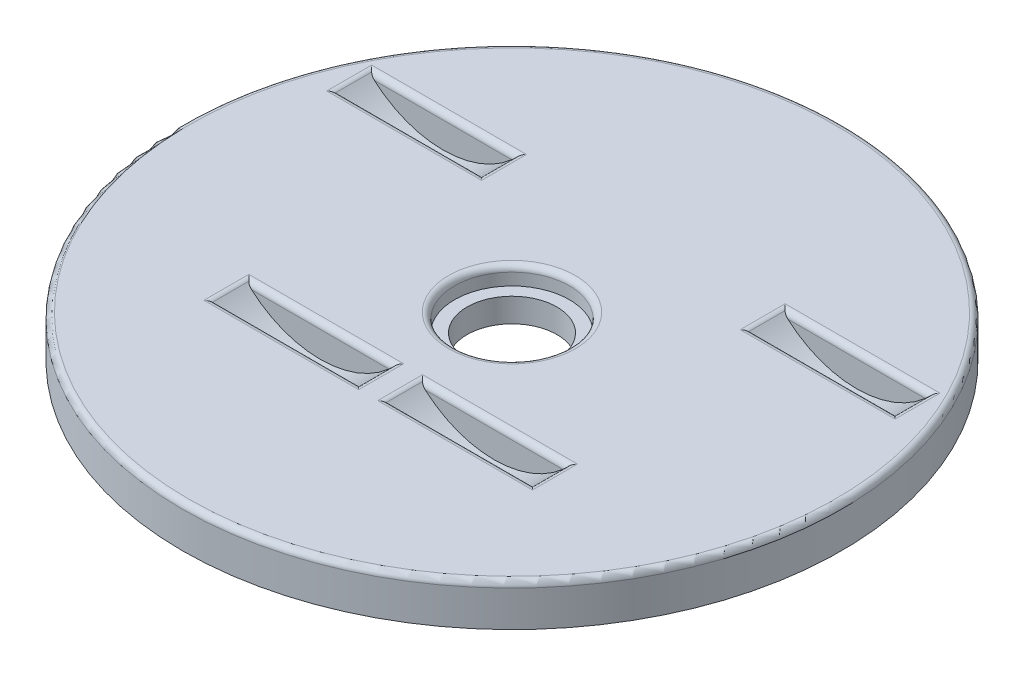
ISO-10303-21;
HEADER;
FILE_DESCRIPTION(('STEP AP214'),'2;1');
FILE_NAME('part.step','',(''),(''),'','','');
FILE_SCHEMA(('AUTOMOTIVE_DESIGN { 1 0 10303 214 1 1 1 1 }'));
ENDSEC;
DATA;
#1=APPLICATION_CONTEXT('core data for automotive mechanical design processes');
#2=APPLICATION_PROTOCOL_DEFINITION('international standard','automotive_design',2000,#1);
#3=PRODUCT_CONTEXT('',#1,'mechanical');
#4=PRODUCT('Part','Part','',(#3));
#5=PRODUCT_RELATED_PRODUCT_CATEGORY('part','',(#4));
#6=PRODUCT_DEFINITION_FORMATION('','',#4);
#7=PRODUCT_DEFINITION_CONTEXT('part definition',#1,'design');
#8=PRODUCT_DEFINITION('design','',#6,#7);
#9=PRODUCT_DEFINITION_SHAPE('','',#8);
#10=(LENGTH_UNIT() NAMED_UNIT(*) SI_UNIT(.MILLI.,.METRE.));
#11=(NAMED_UNIT(*) PLANE_ANGLE_UNIT() SI_UNIT($,.RADIAN.));
#12=(NAMED_UNIT(*) SI_UNIT($,.STERADIAN.) SOLID_ANGLE_UNIT());
#13=UNCERTAINTY_MEASURE_WITH_UNIT(LENGTH_MEASURE(1.E-05),#10,'distance_accuracy_value','');
#14=(GEOMETRIC_REPRESENTATION_CONTEXT(3) GLOBAL_UNCERTAINTY_ASSIGNED_CONTEXT((#13)) GLOBAL_UNIT_ASSIGNED_CONTEXT((#10,
#11,#12)) REPRESENTATION_CONTEXT('',''));
#15=CARTESIAN_POINT('',(0.,0.,0.));
#16=DIRECTION('',(0.,0.,1.));
#17=DIRECTION('',(1.,0.,0.));
#18=AXIS2_PLACEMENT_3D('',#15,#16,#17);
#19=CARTESIAN_POINT('',(0.,0.,0.));
#20=DIRECTION('',(0.,1.,0.));
#21=DIRECTION('',(0.,0.,1.));
#22=AXIS2_PLACEMENT_3D('',#19,#20,#21);
#23=PLANE('',#22);
#24=DIRECTION('',(0.,0.,-1.));
#25=VECTOR('',#24,1.);
#26=CARTESIAN_POINT('',(11.938,0.,2.04759295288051));
#27=LINE('',#26,#25);
#28=CARTESIAN_POINT('',(11.938,0.,-4.445));
#29=VERTEX_POINT('',#28);
#30=CARTESIAN_POINT('',(11.938,0.,-5.842));
#31=VERTEX_POINT('',#30);
#32=EDGE_CURVE('E260',#29,#31,#27,.T.);
#33=ORIENTED_EDGE('',*,*,#32,.T.);
#34=DIRECTION('',(-1.,0.,0.));
#35=VECTOR('',#34,1.);
#36=CARTESIAN_POINT('',(5.588,0.,-5.842));
#37=LINE('',#36,#35);
#38=CARTESIAN_POINT('',(5.588,0.,-5.842));
#39=VERTEX_POINT('',#38);
#40=EDGE_CURVE('E259',#31,#39,#37,.T.);
#41=ORIENTED_EDGE('',*,*,#40,.T.);
#42=DIRECTION('',(0.,0.,-1.));
#43=VECTOR('',#42,1.);
#44=CARTESIAN_POINT('',(5.588,0.,2.04759295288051));
#45=LINE('',#44,#43);
#46=CARTESIAN_POINT('',(5.588,0.,-4.445));
#47=VERTEX_POINT('',#46);
#48=EDGE_CURVE('E244',#47,#39,#45,.T.);
#49=ORIENTED_EDGE('',*,*,#48,.F.);
#50=DIRECTION('',(-1.,0.,0.));
#51=VECTOR('',#50,1.);
#52=CARTESIAN_POINT('',(5.588,0.,-4.445));
#53=LINE('',#52,#51);
#54=EDGE_CURVE('E263',#29,#47,#53,.T.);
#55=ORIENTED_EDGE('',*,*,#54,.F.);
#56=EDGE_LOOP('',(#33,#41,#49,#55));
#57=FACE_BOUND('',#56,.T.);
#58=CARTESIAN_POINT('',(0.,0.,0.));
#59=DIRECTION('',(0.,1.,0.));
#60=DIRECTION('',(0.,0.,1.));
#61=AXIS2_PLACEMENT_3D('',#58,#59,#60);
#62=CIRCLE('',#61,1.905);
#63=CARTESIAN_POINT('',(0.,0.,1.905));
#64=VERTEX_POINT('',#63);
#65=EDGE_CURVE('E347',#64,#64,#62,.T.);
#66=ORIENTED_EDGE('',*,*,#65,.T.);
#67=EDGE_LOOP('',(#66));
#68=FACE_BOUND('',#67,.T.);
#69=CARTESIAN_POINT('',(0.,0.,0.));
#70=DIRECTION('',(0.,1.,0.));
#71=DIRECTION('',(0.,0.,1.));
#72=AXIS2_PLACEMENT_3D('',#69,#70,#71);
#73=CIRCLE('',#72,13.97);
#74=CARTESIAN_POINT('',(0.,0.,13.97));
#75=VERTEX_POINT('',#74);
#76=EDGE_CURVE('E350',#75,#75,#73,.T.);
#77=ORIENTED_EDGE('',*,*,#76,.F.);
#78=EDGE_LOOP('',(#77));
#79=FACE_BOUND('',#78,.T.);
#80=DIRECTION('',(-1.,0.,0.));
#81=VECTOR('',#80,1.);
#82=CARTESIAN_POINT('',(-0.508,0.,4.445));
#83=LINE('',#82,#81);
#84=CARTESIAN_POINT('',(-0.508,0.,4.445));
#85=VERTEX_POINT('',#84);
#86=CARTESIAN_POINT('',(-6.858,0.,4.445));
#87=VERTEX_POINT('',#86);
#88=EDGE_CURVE('E307',#85,#87,#83,.T.);
#89=ORIENTED_EDGE('',*,*,#88,.T.);
#90=DIRECTION('',(0.,0.,1.));
#91=VECTOR('',#90,1.);
#92=CARTESIAN_POINT('',(-6.858,0.,-2.04759295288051));
#93=LINE('',#92,#91);
#94=CARTESIAN_POINT('',(-6.858,0.,5.842));
#95=VERTEX_POINT('',#94);
#96=EDGE_CURVE('E312',#87,#95,#93,.T.);
#97=ORIENTED_EDGE('',*,*,#96,.T.);
#98=DIRECTION('',(-1.,0.,0.));
#99=VECTOR('',#98,1.);
#100=CARTESIAN_POINT('',(-0.508,0.,5.842));
#101=LINE('',#100,#99);
#102=CARTESIAN_POINT('',(-0.508,0.,5.842));
#103=VERTEX_POINT('',#102);
#104=EDGE_CURVE('E304',#103,#95,#101,.T.);
#105=ORIENTED_EDGE('',*,*,#104,.F.);
#106=DIRECTION('',(0.,0.,1.));
#107=VECTOR('',#106,1.);
#108=CARTESIAN_POINT('',(-0.508,0.,-2.04759295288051));
#109=LINE('',#108,#107);
#110=EDGE_CURVE('E315',#85,#103,#109,.T.);
#111=ORIENTED_EDGE('',*,*,#110,.F.);
#112=EDGE_LOOP('',(#89,#97,#105,#111));
#113=FACE_BOUND('',#112,.T.);
#114=DIRECTION('',(-1.,0.,0.));
#115=VECTOR('',#114,1.);
#116=CARTESIAN_POINT('',(0.508,0.,4.445));
#117=LINE('',#116,#115);
#118=CARTESIAN_POINT('',(6.858,0.,4.445));
#119=VERTEX_POINT('',#118);
#120=CARTESIAN_POINT('',(0.508,0.,4.445));
#121=VERTEX_POINT('',#120);
#122=EDGE_CURVE('E291',#119,#121,#117,.T.);
#123=ORIENTED_EDGE('',*,*,#122,.T.);
#124=DIRECTION('',(0.,0.,1.));
#125=VECTOR('',#124,1.);
#126=CARTESIAN_POINT('',(0.508,0.,-2.04759295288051));
#127=LINE('',#126,#125);
#128=CARTESIAN_POINT('',(0.508,0.,5.842));
#129=VERTEX_POINT('',#128);
#130=EDGE_CURVE('E296',#121,#129,#127,.T.);
#131=ORIENTED_EDGE('',*,*,#130,.T.);
#132=DIRECTION('',(-1.,0.,0.));
#133=VECTOR('',#132,1.);
#134=CARTESIAN_POINT('',(0.508,0.,5.842));
#135=LINE('',#134,#133);
#136=CARTESIAN_POINT('',(6.858,0.,5.842));
#137=VERTEX_POINT('',#136);
#138=EDGE_CURVE('E288',#137,#129,#135,.T.);
#139=ORIENTED_EDGE('',*,*,#138,.F.);
#140=DIRECTION('',(0.,0.,1.));
#141=VECTOR('',#140,1.);
#142=CARTESIAN_POINT('',(6.858,0.,-2.04759295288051));
#143=LINE('',#142,#141);
#144=EDGE_CURVE('E299',#119,#137,#143,.T.);
#145=ORIENTED_EDGE('',*,*,#144,.F.);
#146=EDGE_LOOP('',(#123,#131,#139,#145));
#147=FACE_BOUND('',#146,.T.);
#148=DIRECTION('',(-1.,0.,0.));
#149=VECTOR('',#148,1.);
#150=CARTESIAN_POINT('',(-5.588,0.,-5.842));
#151=LINE('',#150,#149);
#152=CARTESIAN_POINT('',(-5.588,0.,-5.842));
#153=VERTEX_POINT('',#152);
#154=CARTESIAN_POINT('',(-11.938,0.,-5.842));
#155=VERTEX_POINT('',#154);
#156=EDGE_CURVE('E272',#153,#155,#151,.T.);
#157=ORIENTED_EDGE('',*,*,#156,.T.);
#158=DIRECTION('',(0.,0.,-1.));
#159=VECTOR('',#158,1.);
#160=CARTESIAN_POINT('',(-11.938,0.,2.04759295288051));
#161=LINE('',#160,#159);
#162=CARTESIAN_POINT('',(-11.938,0.,-4.445));
#163=VERTEX_POINT('',#162);
#164=EDGE_CURVE('E270',#163,#155,#161,.T.);
#165=ORIENTED_EDGE('',*,*,#164,.F.);
#166=DIRECTION('',(-1.,0.,0.));
#167=VECTOR('',#166,1.);
#168=CARTESIAN_POINT('',(-5.588,0.,-4.445));
#169=LINE('',#168,#167);
#170=CARTESIAN_POINT('',(-5.588,0.,-4.445));
#171=VERTEX_POINT('',#170);
#172=EDGE_CURVE('E275',#171,#163,#169,.T.);
#173=ORIENTED_EDGE('',*,*,#172,.F.);
#174=DIRECTION('',(0.,0.,-1.));
#175=VECTOR('',#174,1.);
#176=CARTESIAN_POINT('',(-5.588,0.,2.04759295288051));
#177=LINE('',#176,#175);
#178=EDGE_CURVE('E276',#171,#153,#177,.T.);
#179=ORIENTED_EDGE('',*,*,#178,.T.);
#180=EDGE_LOOP('',(#157,#165,#173,#179));
#181=FACE_BOUND('',#180,.T.);
#182=ADVANCED_FACE('F30',(#57,#68,#79,#113,#147,#181),#23,.F.);
#183=CARTESIAN_POINT('',(0.,1.778,0.));
#184=DIRECTION('',(0.,-1.,0.));
#185=DIRECTION('',(0.,0.,-1.));
#186=AXIS2_PLACEMENT_3D('',#183,#184,#185);
#187=CYLINDRICAL_SURFACE('',#186,1.905);
#188=ORIENTED_EDGE('',*,*,#65,.F.);
#189=EDGE_LOOP('',(#188));
#190=FACE_BOUND('',#189,.T.);
#191=CARTESIAN_POINT('',(0.,1.016,0.));
#192=DIRECTION('',(0.,1.,0.));
#193=DIRECTION('',(0.,0.,1.));
#194=AXIS2_PLACEMENT_3D('',#191,#192,#193);
#195=CIRCLE('',#194,1.905);
#196=CARTESIAN_POINT('',(0.,1.016,1.905));
#197=VERTEX_POINT('',#196);
#198=EDGE_CURVE('E322',#197,#197,#195,.T.);
#199=ORIENTED_EDGE('',*,*,#198,.T.);
#200=EDGE_LOOP('',(#199));
#201=FACE_BOUND('',#200,.T.);
#202=ADVANCED_FACE('F543',(#190,#201),#187,.F.);
#203=CARTESIAN_POINT('',(0.,1.778,0.));
#204=DIRECTION('',(0.,1.,0.));
#205=DIRECTION('',(0.,0.,1.));
#206=AXIS2_PLACEMENT_3D('',#203,#204,#205);
#207=PLANE('',#206);
#208=DIRECTION('',(0.,0.,-1.));
#209=VECTOR('',#208,1.);
#210=CARTESIAN_POINT('',(5.48152596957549,1.778,0.));
#211=LINE('',#210,#209);
#212=CARTESIAN_POINT('',(5.48152596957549,1.778,-4.191));
#213=VERTEX_POINT('',#212);
#214=CARTESIAN_POINT('',(5.48152596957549,1.778,-6.096));
#215=VERTEX_POINT('',#214);
#216=EDGE_CURVE('E395',#213,#215,#211,.T.);
#217=ORIENTED_EDGE('',*,*,#216,.T.);
#218=DIRECTION('',(-1.,0.,0.));
#219=VECTOR('',#218,1.);
#220=CARTESIAN_POINT('',(11.938,1.778,-6.096));
#221=LINE('',#220,#219);
#222=CARTESIAN_POINT('',(12.0444740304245,1.778,-6.096));
#223=VERTEX_POINT('',#222);
#224=EDGE_CURVE('E397',#215,#223,#221,.F.);
#225=ORIENTED_EDGE('',*,*,#224,.T.);
#226=DIRECTION('',(0.,0.,-1.));
#227=VECTOR('',#226,1.);
#228=CARTESIAN_POINT('',(12.0444740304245,1.778,0.));
#229=LINE('',#228,#227);
#230=CARTESIAN_POINT('',(12.0444740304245,1.778,-4.191));
#231=VERTEX_POINT('',#230);
#232=EDGE_CURVE('E391',#223,#231,#229,.F.);
#233=ORIENTED_EDGE('',*,*,#232,.T.);
#234=DIRECTION('',(-1.,0.,0.));
#235=VECTOR('',#234,1.);
#236=CARTESIAN_POINT('',(0.,1.778,-4.191));
#237=LINE('',#236,#235);
#238=EDGE_CURVE('E393',#231,#213,#237,.T.);
#239=ORIENTED_EDGE('',*,*,#238,.T.);
#240=EDGE_LOOP('',(#217,#225,#233,#239));
#241=FACE_BOUND('',#240,.T.);
#242=DIRECTION('',(-1.,0.,0.));
#243=VECTOR('',#242,1.);
#244=CARTESIAN_POINT('',(0.,1.778,-6.096));
#245=LINE('',#244,#243);
#246=CARTESIAN_POINT('',(-12.0444740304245,1.778,-6.096));
#247=VERTEX_POINT('',#246);
#248=CARTESIAN_POINT('',(-5.48152596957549,1.778,-6.096));
#249=VERTEX_POINT('',#248);
#250=EDGE_CURVE('E386',#247,#249,#245,.F.);
#251=ORIENTED_EDGE('',*,*,#250,.T.);
#252=DIRECTION('',(0.,0.,-1.));
#253=VECTOR('',#252,1.);
#254=CARTESIAN_POINT('',(-5.48152596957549,1.778,0.));
#255=LINE('',#254,#253);
#256=CARTESIAN_POINT('',(-5.48152596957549,1.778,-4.191));
#257=VERTEX_POINT('',#256);
#258=EDGE_CURVE('E388',#249,#257,#255,.F.);
#259=ORIENTED_EDGE('',*,*,#258,.T.);
#260=DIRECTION('',(-1.,0.,0.));
#261=VECTOR('',#260,1.);
#262=CARTESIAN_POINT('',(-11.938,1.778,-4.191));
#263=LINE('',#262,#261);
#264=CARTESIAN_POINT('',(-12.0444740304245,1.778,-4.191));
#265=VERTEX_POINT('',#264);
#266=EDGE_CURVE('E382',#257,#265,#263,.T.);
#267=ORIENTED_EDGE('',*,*,#266,.T.);
#268=DIRECTION('',(0.,0.,-1.));
#269=VECTOR('',#268,1.);
#270=CARTESIAN_POINT('',(-12.0444740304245,1.778,0.));
#271=LINE('',#270,#269);
#272=EDGE_CURVE('E384',#265,#247,#271,.T.);
#273=ORIENTED_EDGE('',*,*,#272,.T.);
#274=EDGE_LOOP('',(#251,#259,#267,#273));
#275=FACE_BOUND('',#274,.T.);
#276=DIRECTION('',(-1.,0.,0.));
#277=VECTOR('',#276,1.);
#278=CARTESIAN_POINT('',(0.,1.778,6.096));
#279=LINE('',#278,#277);
#280=CARTESIAN_POINT('',(6.96447403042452,1.778,6.096));
#281=VERTEX_POINT('',#280);
#282=CARTESIAN_POINT('',(0.401525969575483,1.778,6.096));
#283=VERTEX_POINT('',#282);
#284=EDGE_CURVE('E377',#281,#283,#279,.T.);
#285=ORIENTED_EDGE('',*,*,#284,.T.);
#286=DIRECTION('',(0.,0.,-1.));
#287=VECTOR('',#286,1.);
#288=CARTESIAN_POINT('',(0.401525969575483,1.778,4.445));
#289=LINE('',#288,#287);
#290=CARTESIAN_POINT('',(0.401525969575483,1.778,4.191));
#291=VERTEX_POINT('',#290);
#292=EDGE_CURVE('E379',#283,#291,#289,.T.);
#293=ORIENTED_EDGE('',*,*,#292,.T.);
#294=DIRECTION('',(-1.,0.,0.));
#295=VECTOR('',#294,1.);
#296=CARTESIAN_POINT('',(6.858,1.778,4.191));
#297=LINE('',#296,#295);
#298=CARTESIAN_POINT('',(6.96447403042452,1.778,4.191));
#299=VERTEX_POINT('',#298);
#300=EDGE_CURVE('E373',#291,#299,#297,.F.);
#301=ORIENTED_EDGE('',*,*,#300,.T.);
#302=DIRECTION('',(0.,0.,-1.));
#303=VECTOR('',#302,1.);
#304=CARTESIAN_POINT('',(6.96447403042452,1.778,5.842));
#305=LINE('',#304,#303);
#306=EDGE_CURVE('E375',#299,#281,#305,.F.);
#307=ORIENTED_EDGE('',*,*,#306,.T.);
#308=EDGE_LOOP('',(#285,#293,#301,#307));
#309=FACE_BOUND('',#308,.T.);
#310=CARTESIAN_POINT('',(0.,1.778,0.));
#311=DIRECTION('',(0.,1.,0.));
#312=DIRECTION('',(0.,0.,1.));
#313=AXIS2_PLACEMENT_3D('',#310,#311,#312);
#314=CIRCLE('',#313,13.716);
#315=CARTESIAN_POINT('',(0.,1.778,13.716));
#316=VERTEX_POINT('',#315);
#317=EDGE_CURVE('E370',#316,#316,#314,.T.);
#318=ORIENTED_EDGE('',*,*,#317,.T.);
#319=EDGE_LOOP('',(#318));
#320=FACE_BOUND('',#319,.T.);
#321=DIRECTION('',(0.,0.,-1.));
#322=VECTOR('',#321,1.);
#323=CARTESIAN_POINT('',(-0.401525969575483,1.778,5.842));
#324=LINE('',#323,#322);
#325=CARTESIAN_POINT('',(-0.401525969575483,1.778,4.191));
#326=VERTEX_POINT('',#325);
#327=CARTESIAN_POINT('',(-0.401525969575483,1.778,6.096));
#328=VERTEX_POINT('',#327);
#329=EDGE_CURVE('E365',#326,#328,#324,.F.);
#330=ORIENTED_EDGE('',*,*,#329,.T.);
#331=DIRECTION('',(-1.,0.,0.));
#332=VECTOR('',#331,1.);
#333=CARTESIAN_POINT('',(-6.858,1.778,6.096));
#334=LINE('',#333,#332);
#335=CARTESIAN_POINT('',(-6.96447403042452,1.778,6.096));
#336=VERTEX_POINT('',#335);
#337=EDGE_CURVE('E367',#328,#336,#334,.T.);
#338=ORIENTED_EDGE('',*,*,#337,.T.);
#339=DIRECTION('',(0.,0.,-1.));
#340=VECTOR('',#339,1.);
#341=CARTESIAN_POINT('',(-6.96447403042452,1.778,4.445));
#342=LINE('',#341,#340);
#343=CARTESIAN_POINT('',(-6.96447403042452,1.778,4.191));
#344=VERTEX_POINT('',#343);
#345=EDGE_CURVE('E361',#336,#344,#342,.T.);
#346=ORIENTED_EDGE('',*,*,#345,.T.);
#347=DIRECTION('',(-1.,0.,0.));
#348=VECTOR('',#347,1.);
#349=CARTESIAN_POINT('',(0.,1.778,4.191));
#350=LINE('',#349,#348);
#351=EDGE_CURVE('E363',#344,#326,#350,.F.);
#352=ORIENTED_EDGE('',*,*,#351,.T.);
#353=EDGE_LOOP('',(#330,#338,#346,#352));
#354=FACE_BOUND('',#353,.T.);
#355=CARTESIAN_POINT('',(0.,1.778,0.));
#356=DIRECTION('',(0.,1.,0.));
#357=DIRECTION('',(0.,0.,1.));
#358=AXIS2_PLACEMENT_3D('',#355,#356,#357);
#359=CIRCLE('',#358,2.68952708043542);
#360=CARTESIAN_POINT('',(0.,1.778,2.68952708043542));
#361=VERTEX_POINT('',#360);
#362=EDGE_CURVE('E358',#361,#361,#359,.F.);
#363=ORIENTED_EDGE('',*,*,#362,.T.);
#364=EDGE_LOOP('',(#363));
#365=FACE_BOUND('',#364,.T.);
#366=ADVANCED_FACE('F548',(#241,#275,#309,#320,#354,#365),#207,.T.);
#367=CARTESIAN_POINT('',(0.,1.778,0.));
#368=DIRECTION('',(0.,-1.,0.));
#369=DIRECTION('',(0.,0.,-1.));
#370=AXIS2_PLACEMENT_3D('',#367,#368,#369);
#371=CYLINDRICAL_SURFACE('',#370,13.97);
#372=CARTESIAN_POINT('',(0.,1.524,0.));
#373=DIRECTION('',(0.,1.,0.));
#374=DIRECTION('',(0.,0.,1.));
#375=AXIS2_PLACEMENT_3D('',#372,#373,#374);
#376=CIRCLE('',#375,13.97);
#377=CARTESIAN_POINT('',(0.,1.524,13.97));
#378=VERTEX_POINT('',#377);
#379=EDGE_CURVE('E422',#378,#378,#376,.F.);
#380=ORIENTED_EDGE('',*,*,#379,.T.);
#381=EDGE_LOOP('',(#380));
#382=FACE_BOUND('',#381,.T.);
#383=ORIENTED_EDGE('',*,*,#76,.T.);
#384=EDGE_LOOP('',(#383));
#385=FACE_BOUND('',#384,.T.);
#386=ADVANCED_FACE('F32',(#382,#385),#371,.T.);
#387=CARTESIAN_POINT('',(-3.683,4.826,4.445));
#388=DIRECTION('',(0.,0.,1.));
#389=DIRECTION('',(1.,0.,0.));
#390=AXIS2_PLACEMENT_3D('',#387,#388,#389);
#391=CYLINDRICAL_SURFACE('',#390,4.40124175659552);
#392=CARTESIAN_POINT('',(-0.77306443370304,1.524,5.842));
#393=CARTESIAN_POINT('',(-0.761651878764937,1.53405722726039,5.84200514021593));
#394=CARTESIAN_POINT('',(-0.75029804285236,1.54416859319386,5.84259767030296));
#395=CARTESIAN_POINT('',(-0.727743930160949,1.56446329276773,5.84503363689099));
#396=CARTESIAN_POINT('',(-0.716544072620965,1.57464673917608,5.84687998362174));
#397=CARTESIAN_POINT('',(-0.684030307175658,1.60451736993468,5.85424727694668));
#398=CARTESIAN_POINT('',(-0.663050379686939,1.62418843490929,5.86158984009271));
#399=CARTESIAN_POINT('',(-0.631968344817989,1.65387607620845,5.87738825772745));
#400=CARTESIAN_POINT('',(-0.621207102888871,1.66426640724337,5.88386840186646));
#401=CARTESIAN_POINT('',(-0.600301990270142,1.68464326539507,5.89884274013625));
#402=CARTESIAN_POINT('',(-0.590172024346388,1.69461969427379,5.90736984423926));
#403=CARTESIAN_POINT('',(-0.580570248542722,1.70416422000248,5.91695572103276));
#404=B_SPLINE_CURVE_WITH_KNOTS('',3,(#392,#393,#394,#395,#396,#397,#398,#399,#400,#401,#402,
#403),.UNSPECIFIED.,.F.,.F.,(4,2,2,2,2,4),(0.,0.0456036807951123,0.0913135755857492,
0.179759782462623,0.228544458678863,0.278173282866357),.UNSPECIFIED.);
#405=CARTESIAN_POINT('',(-0.773064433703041,1.524,5.842));
#406=VERTEX_POINT('',#405);
#407=CARTESIAN_POINT('',(-0.580570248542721,1.70416422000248,5.91695572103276));
#408=VERTEX_POINT('',#407);
#409=EDGE_CURVE('E600',#406,#408,#404,.T.);
#410=ORIENTED_EDGE('',*,*,#409,.T.);
#411=DIRECTION('',(0.,0.,1.));
#412=VECTOR('',#411,1.);
#413=CARTESIAN_POINT('',(-0.580570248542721,1.70416422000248,4.445));
#414=LINE('',#413,#412);
#415=CARTESIAN_POINT('',(-0.580570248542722,1.70416422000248,4.37004427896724));
#416=VERTEX_POINT('',#415);
#417=EDGE_CURVE('E57',#408,#416,#414,.F.);
#418=ORIENTED_EDGE('',*,*,#417,.T.);
#419=CARTESIAN_POINT('',(-0.580570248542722,1.70416422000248,4.37004427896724));
#420=CARTESIAN_POINT('',(-0.593256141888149,1.69154884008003,4.38268962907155));
#421=CARTESIAN_POINT('',(-0.606839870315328,1.67821123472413,4.39349740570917));
#422=CARTESIAN_POINT('',(-0.635001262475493,1.65094170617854,4.41160660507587));
#423=CARTESIAN_POINT('',(-0.649551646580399,1.63702845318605,4.41897770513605));
#424=CARTESIAN_POINT('',(-0.681609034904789,1.60681737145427,4.43175836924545));
#425=CARTESIAN_POINT('',(-0.699237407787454,1.59046815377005,4.43672397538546));
#426=CARTESIAN_POINT('',(-0.735553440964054,1.55734281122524,4.4433741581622));
#427=CARTESIAN_POINT('',(-0.754256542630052,1.54056618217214,4.44497405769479));
#428=CARTESIAN_POINT('',(-0.773064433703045,1.524,4.445));
#429=B_SPLINE_CURVE_WITH_KNOTS('',3,(#419,#420,#421,#422,#423,#424,#425,#426,#427,#428),
.UNSPECIFIED.,.F.,.F.,(4,2,2,2,4),(0.,0.0654391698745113,0.129486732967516,0.202892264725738,
0.278123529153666),.UNSPECIFIED.);
#430=CARTESIAN_POINT('',(-0.773064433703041,1.524,4.445));
#431=VERTEX_POINT('',#430);
#432=EDGE_CURVE('E11',#416,#431,#429,.T.);
#433=ORIENTED_EDGE('',*,*,#432,.T.);
#434=CARTESIAN_POINT('',(-3.683,4.826,4.445));
#435=DIRECTION('',(0.,0.,1.));
#436=DIRECTION('',(1.,0.,0.));
#437=AXIS2_PLACEMENT_3D('',#434,#435,#436);
#438=CIRCLE('',#437,4.40124175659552);
#439=CARTESIAN_POINT('',(-6.59293556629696,1.524,4.445));
#440=VERTEX_POINT('',#439);
#441=EDGE_CURVE('E344',#440,#431,#438,.T.);
#442=ORIENTED_EDGE('',*,*,#441,.F.);
#443=CARTESIAN_POINT('',(-6.59293556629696,1.524,4.445));
#444=CARTESIAN_POINT('',(-6.60434812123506,1.53405722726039,4.44499485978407));
#445=CARTESIAN_POINT('',(-6.61570195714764,1.54416859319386,4.44440232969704));
#446=CARTESIAN_POINT('',(-6.63825606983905,1.56446329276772,4.44196636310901));
#447=CARTESIAN_POINT('',(-6.64945592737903,1.57464673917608,4.44012001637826));
#448=CARTESIAN_POINT('',(-6.68196969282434,1.60451736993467,4.43275272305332));
#449=CARTESIAN_POINT('',(-6.70294962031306,1.62418843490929,4.42541015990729));
#450=CARTESIAN_POINT('',(-6.73403165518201,1.65387607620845,4.40961174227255));
#451=CARTESIAN_POINT('',(-6.74479289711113,1.66426640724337,4.40313159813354));
#452=CARTESIAN_POINT('',(-6.76569800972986,1.68464326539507,4.38815725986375));
#453=CARTESIAN_POINT('',(-6.77582797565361,1.69461969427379,4.37963015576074));
#454=CARTESIAN_POINT('',(-6.78542975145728,1.70416422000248,4.37004427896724));
#455=B_SPLINE_CURVE_WITH_KNOTS('',3,(#443,#444,#445,#446,#447,#448,#449,#450,#451,#452,#453,
#454),.UNSPECIFIED.,.F.,.F.,(4,2,2,2,2,4),(0.,0.0456036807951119,0.091313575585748,
0.179759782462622,0.228544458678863,0.278173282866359),.UNSPECIFIED.);
#456=CARTESIAN_POINT('',(-6.78542975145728,1.70416422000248,4.37004427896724));
#457=VERTEX_POINT('',#456);
#458=EDGE_CURVE('E43',#440,#457,#455,.T.);
#459=ORIENTED_EDGE('',*,*,#458,.T.);
#460=DIRECTION('',(0.,0.,1.));
#461=VECTOR('',#460,1.);
#462=CARTESIAN_POINT('',(-6.78542975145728,1.70416422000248,4.445));
#463=LINE('',#462,#461);
#464=CARTESIAN_POINT('',(-6.78542975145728,1.70416422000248,5.91695572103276));
#465=VERTEX_POINT('',#464);
#466=EDGE_CURVE('E50',#457,#465,#463,.T.);
#467=ORIENTED_EDGE('',*,*,#466,.T.);
#468=CARTESIAN_POINT('',(-6.78542975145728,1.70416422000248,5.91695572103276));
#469=CARTESIAN_POINT('',(-6.77274385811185,1.69154884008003,5.90431037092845));
#470=CARTESIAN_POINT('',(-6.75916012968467,1.67821123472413,5.89350259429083));
#471=CARTESIAN_POINT('',(-6.73099873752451,1.65094170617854,5.87539339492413));
#472=CARTESIAN_POINT('',(-6.7164483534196,1.63702845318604,5.86802229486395));
#473=CARTESIAN_POINT('',(-6.68439096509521,1.60681737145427,5.85524163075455));
#474=CARTESIAN_POINT('',(-6.66676259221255,1.59046815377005,5.85027602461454));
#475=CARTESIAN_POINT('',(-6.63044655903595,1.55734281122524,5.8436258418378));
#476=CARTESIAN_POINT('',(-6.61174345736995,1.54056618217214,5.84202594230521));
#477=CARTESIAN_POINT('',(-6.59293556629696,1.524,5.842));
#478=B_SPLINE_CURVE_WITH_KNOTS('',3,(#468,#469,#470,#471,#472,#473,#474,#475,#476,#477),
.UNSPECIFIED.,.F.,.F.,(4,2,2,2,4),(0.,0.0654391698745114,0.129486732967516,0.202892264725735,
0.278123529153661),.UNSPECIFIED.);
#479=CARTESIAN_POINT('',(-6.59293556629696,1.524,5.842));
#480=VERTEX_POINT('',#479);
#481=EDGE_CURVE('E594',#465,#480,#478,.T.);
#482=ORIENTED_EDGE('',*,*,#481,.T.);
#483=CARTESIAN_POINT('',(-3.683,4.826,5.842));
#484=DIRECTION('',(0.,0.,1.));
#485=DIRECTION('',(1.,0.,0.));
#486=AXIS2_PLACEMENT_3D('',#483,#484,#485);
#487=CIRCLE('',#486,4.40124175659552);
#488=EDGE_CURVE('E341',#480,#406,#487,.T.);
#489=ORIENTED_EDGE('',*,*,#488,.T.);
#490=EDGE_LOOP('',(#410,#418,#433,#442,#459,#467,#482,#489));
#491=FACE_BOUND('',#490,.T.);
#492=ADVANCED_FACE('F556',(#491),#391,.F.);
#493=CARTESIAN_POINT('',(-3.683,4.826,4.445));
#494=DIRECTION('',(0.,0.,1.));
#495=DIRECTION('',(1.,0.,0.));
#496=AXIS2_PLACEMENT_3D('',#493,#494,#495);
#497=PLANE('',#496);
#498=ORIENTED_EDGE('',*,*,#441,.T.);
#499=DIRECTION('',(-1.,0.,0.));
#500=VECTOR('',#499,1.);
#501=CARTESIAN_POINT('',(-3.683,1.524,4.445));
#502=LINE('',#501,#500);
#503=EDGE_CURVE('E430',#431,#440,#502,.T.);
#504=ORIENTED_EDGE('',*,*,#503,.T.);
#505=EDGE_LOOP('',(#498,#504));
#506=FACE_BOUND('',#505,.T.);
#507=ADVANCED_FACE('F610',(#506),#497,.T.);
#508=CARTESIAN_POINT('',(-3.683,4.826,5.842));
#509=DIRECTION('',(0.,0.,1.));
#510=DIRECTION('',(1.,0.,0.));
#511=AXIS2_PLACEMENT_3D('',#508,#509,#510);
#512=PLANE('',#511);
#513=ORIENTED_EDGE('',*,*,#488,.F.);
#514=DIRECTION('',(-1.,0.,0.));
#515=VECTOR('',#514,1.);
#516=CARTESIAN_POINT('',(-0.508,1.524,5.842));
#517=LINE('',#516,#515);
#518=EDGE_CURVE('E425',#480,#406,#517,.F.);
#519=ORIENTED_EDGE('',*,*,#518,.T.);
#520=EDGE_LOOP('',(#513,#519));
#521=FACE_BOUND('',#520,.T.);
#522=ADVANCED_FACE('F616',(#521),#512,.F.);
#523=CARTESIAN_POINT('',(3.683,4.826,4.445));
#524=DIRECTION('',(0.,0.,1.));
#525=DIRECTION('',(1.,0.,0.));
#526=AXIS2_PLACEMENT_3D('',#523,#524,#525);
#527=CYLINDRICAL_SURFACE('',#526,4.40124175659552);
#528=CARTESIAN_POINT('',(3.683,4.826,4.445));
#529=DIRECTION('',(0.,0.,1.));
#530=DIRECTION('',(-1.,0.,0.));
#531=AXIS2_PLACEMENT_3D('',#528,#529,#530);
#532=CIRCLE('',#531,4.40124175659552);
#533=CARTESIAN_POINT('',(0.773064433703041,1.524,4.445));
#534=VERTEX_POINT('',#533);
#535=CARTESIAN_POINT('',(6.59293556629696,1.524,4.445));
#536=VERTEX_POINT('',#535);
#537=EDGE_CURVE('E338',#534,#536,#532,.T.);
#538=ORIENTED_EDGE('',*,*,#537,.F.);
#539=CARTESIAN_POINT('',(0.773064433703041,1.524,4.445));
#540=CARTESIAN_POINT('',(0.761651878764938,1.53405722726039,4.44499485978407));
#541=CARTESIAN_POINT('',(0.750298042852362,1.54416859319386,4.44440232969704));
#542=CARTESIAN_POINT('',(0.727743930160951,1.56446329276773,4.44196636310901));
#543=CARTESIAN_POINT('',(0.716544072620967,1.57464673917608,4.44012001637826));
#544=CARTESIAN_POINT('',(0.68403030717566,1.60451736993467,4.43275272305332));
#545=CARTESIAN_POINT('',(0.663050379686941,1.62418843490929,4.42541015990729));
#546=CARTESIAN_POINT('',(0.631968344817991,1.65387607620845,4.40961174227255));
#547=CARTESIAN_POINT('',(0.621207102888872,1.66426640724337,4.40313159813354));
#548=CARTESIAN_POINT('',(0.600301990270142,1.68464326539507,4.38815725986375));
#549=CARTESIAN_POINT('',(0.590172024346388,1.69461969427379,4.37963015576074));
#550=CARTESIAN_POINT('',(0.580570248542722,1.70416422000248,4.37004427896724));
#551=B_SPLINE_CURVE_WITH_KNOTS('',3,(#539,#540,#541,#542,#543,#544,#545,#546,#547,#548,#549,
#550),.UNSPECIFIED.,.F.,.F.,(4,2,2,2,2,4),(0.,0.0456036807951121,0.0913135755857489,
0.179759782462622,0.228544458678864,0.278173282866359),.UNSPECIFIED.);
#552=CARTESIAN_POINT('',(0.580570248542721,1.70416422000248,4.37004427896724));
#553=VERTEX_POINT('',#552);
#554=EDGE_CURVE('E644',#534,#553,#551,.T.);
#555=ORIENTED_EDGE('',*,*,#554,.T.);
#556=DIRECTION('',(0.,0.,1.));
#557=VECTOR('',#556,1.);
#558=CARTESIAN_POINT('',(0.580570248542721,1.70416422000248,4.445));
#559=LINE('',#558,#557);
#560=CARTESIAN_POINT('',(0.580570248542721,1.70416422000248,5.91695572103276));
#561=VERTEX_POINT('',#560);
#562=EDGE_CURVE('E416',#553,#561,#559,.T.);
#563=ORIENTED_EDGE('',*,*,#562,.T.);
#564=CARTESIAN_POINT('',(0.580570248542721,1.70416422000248,5.91695572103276));
#565=CARTESIAN_POINT('',(0.593256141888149,1.69154884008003,5.90431037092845));
#566=CARTESIAN_POINT('',(0.606839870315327,1.67821123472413,5.89350259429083));
#567=CARTESIAN_POINT('',(0.635001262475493,1.65094170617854,5.87539339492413));
#568=CARTESIAN_POINT('',(0.649551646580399,1.63702845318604,5.86802229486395));
#569=CARTESIAN_POINT('',(0.681609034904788,1.60681737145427,5.85524163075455));
#570=CARTESIAN_POINT('',(0.699237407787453,1.59046815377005,5.85027602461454));
#571=CARTESIAN_POINT('',(0.735553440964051,1.55734281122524,5.8436258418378));
#572=CARTESIAN_POINT('',(0.754256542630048,1.54056618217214,5.84202594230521));
#573=CARTESIAN_POINT('',(0.773064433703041,1.524,5.842));
#574=B_SPLINE_CURVE_WITH_KNOTS('',3,(#564,#565,#566,#567,#568,#569,#570,#571,#572,#573),
.UNSPECIFIED.,.F.,.F.,(4,2,2,2,4),(0.,0.0654391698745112,0.129486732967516,0.202892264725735,
0.27812352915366),.UNSPECIFIED.);
#575=CARTESIAN_POINT('',(0.773064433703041,1.524,5.842));
#576=VERTEX_POINT('',#575);
#577=EDGE_CURVE('E631',#561,#576,#574,.T.);
#578=ORIENTED_EDGE('',*,*,#577,.T.);
#579=CARTESIAN_POINT('',(3.683,4.826,5.842));
#580=DIRECTION('',(0.,0.,1.));
#581=DIRECTION('',(-1.,0.,0.));
#582=AXIS2_PLACEMENT_3D('',#579,#580,#581);
#583=CIRCLE('',#582,4.40124175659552);
#584=CARTESIAN_POINT('',(6.59293556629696,1.524,5.842));
#585=VERTEX_POINT('',#584);
#586=EDGE_CURVE('E335',#576,#585,#583,.T.);
#587=ORIENTED_EDGE('',*,*,#586,.T.);
#588=CARTESIAN_POINT('',(6.59293556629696,1.524,5.842));
#589=CARTESIAN_POINT('',(6.60434812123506,1.53405722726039,5.84200514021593));
#590=CARTESIAN_POINT('',(6.61570195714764,1.54416859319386,5.84259767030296));
#591=CARTESIAN_POINT('',(6.63825606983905,1.56446329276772,5.84503363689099));
#592=CARTESIAN_POINT('',(6.64945592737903,1.57464673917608,5.84687998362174));
#593=CARTESIAN_POINT('',(6.68196969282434,1.60451736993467,5.85424727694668));
#594=CARTESIAN_POINT('',(6.70294962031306,1.62418843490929,5.86158984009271));
#595=CARTESIAN_POINT('',(6.73403165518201,1.65387607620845,5.87738825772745));
#596=CARTESIAN_POINT('',(6.74479289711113,1.66426640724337,5.88386840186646));
#597=CARTESIAN_POINT('',(6.76569800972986,1.68464326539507,5.89884274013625));
#598=CARTESIAN_POINT('',(6.77582797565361,1.69461969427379,5.90736984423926));
#599=CARTESIAN_POINT('',(6.78542975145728,1.70416422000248,5.91695572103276));
#600=B_SPLINE_CURVE_WITH_KNOTS('',3,(#588,#589,#590,#591,#592,#593,#594,#595,#596,#597,#598,
#599),.UNSPECIFIED.,.F.,.F.,(4,2,2,2,2,4),(0.,0.0456036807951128,0.0913135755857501,
0.179759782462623,0.228544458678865,0.278173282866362),.UNSPECIFIED.);
#601=CARTESIAN_POINT('',(6.78542975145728,1.70416422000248,5.91695572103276));
#602=VERTEX_POINT('',#601);
#603=EDGE_CURVE('E639',#585,#602,#600,.T.);
#604=ORIENTED_EDGE('',*,*,#603,.T.);
#605=DIRECTION('',(0.,0.,1.));
#606=VECTOR('',#605,1.);
#607=CARTESIAN_POINT('',(6.78542975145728,1.70416422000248,4.445));
#608=LINE('',#607,#606);
#609=CARTESIAN_POINT('',(6.78542975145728,1.70416422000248,4.37004427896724));
#610=VERTEX_POINT('',#609);
#611=EDGE_CURVE('E414',#602,#610,#608,.F.);
#612=ORIENTED_EDGE('',*,*,#611,.T.);
#613=CARTESIAN_POINT('',(6.78542975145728,1.70416422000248,4.37004427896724));
#614=CARTESIAN_POINT('',(6.77274385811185,1.69154884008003,4.38268962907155));
#615=CARTESIAN_POINT('',(6.75916012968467,1.67821123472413,4.39349740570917));
#616=CARTESIAN_POINT('',(6.73099873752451,1.65094170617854,4.41160660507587));
#617=CARTESIAN_POINT('',(6.7164483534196,1.63702845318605,4.41897770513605));
#618=CARTESIAN_POINT('',(6.68439096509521,1.60681737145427,4.43175836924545));
#619=CARTESIAN_POINT('',(6.66676259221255,1.59046815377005,4.43672397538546));
#620=CARTESIAN_POINT('',(6.63044655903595,1.55734281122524,4.4433741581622));
#621=CARTESIAN_POINT('',(6.61174345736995,1.54056618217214,4.44497405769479));
#622=CARTESIAN_POINT('',(6.59293556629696,1.524,4.445));
#623=B_SPLINE_CURVE_WITH_KNOTS('',3,(#613,#614,#615,#616,#617,#618,#619,#620,#621,#622),
.UNSPECIFIED.,.F.,.F.,(4,2,2,2,4),(0.,0.0654391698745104,0.129486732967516,0.202892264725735,
0.27812352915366),.UNSPECIFIED.);
#624=EDGE_CURVE('E650',#610,#536,#623,.T.);
#625=ORIENTED_EDGE('',*,*,#624,.T.);
#626=EDGE_LOOP('',(#538,#555,#563,#578,#587,#604,#612,#625));
#627=FACE_BOUND('',#626,.T.);
#628=ADVANCED_FACE('F620',(#627),#527,.F.);
#629=CARTESIAN_POINT('',(3.683,4.826,4.445));
#630=DIRECTION('',(0.,0.,-1.));
#631=DIRECTION('',(-1.,0.,0.));
#632=AXIS2_PLACEMENT_3D('',#629,#630,#631);
#633=PLANE('',#632);
#634=ORIENTED_EDGE('',*,*,#537,.T.);
#635=DIRECTION('',(-1.,0.,0.));
#636=VECTOR('',#635,1.);
#637=CARTESIAN_POINT('',(0.508,1.524,4.445));
#638=LINE('',#637,#636);
#639=EDGE_CURVE('E420',#536,#534,#638,.T.);
#640=ORIENTED_EDGE('',*,*,#639,.T.);
#641=EDGE_LOOP('',(#634,#640));
#642=FACE_BOUND('',#641,.T.);
#643=ADVANCED_FACE('F625',(#642),#633,.F.);
#644=CARTESIAN_POINT('',(3.683,4.826,5.842));
#645=DIRECTION('',(0.,0.,-1.));
#646=DIRECTION('',(-1.,0.,0.));
#647=AXIS2_PLACEMENT_3D('',#644,#645,#646);
#648=PLANE('',#647);
#649=ORIENTED_EDGE('',*,*,#586,.F.);
#650=DIRECTION('',(-1.,0.,0.));
#651=VECTOR('',#650,1.);
#652=CARTESIAN_POINT('',(3.683,1.524,5.842));
#653=LINE('',#652,#651);
#654=EDGE_CURVE('E418',#576,#585,#653,.F.);
#655=ORIENTED_EDGE('',*,*,#654,.T.);
#656=EDGE_LOOP('',(#649,#655));
#657=FACE_BOUND('',#656,.T.);
#658=ADVANCED_FACE('F698',(#657),#648,.T.);
#659=CARTESIAN_POINT('',(-8.763,4.826,-4.445));
#660=DIRECTION('',(0.,0.,-1.));
#661=DIRECTION('',(-1.,0.,0.));
#662=AXIS2_PLACEMENT_3D('',#659,#660,#661);
#663=CYLINDRICAL_SURFACE('',#662,4.40124175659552);
#664=CARTESIAN_POINT('',(-8.763,4.826,-4.445));
#665=DIRECTION('',(0.,0.,1.));
#666=DIRECTION('',(1.,0.,0.));
#667=AXIS2_PLACEMENT_3D('',#664,#665,#666);
#668=CIRCLE('',#667,4.40124175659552);
#669=CARTESIAN_POINT('',(-11.672935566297,1.524,-4.445));
#670=VERTEX_POINT('',#669);
#671=CARTESIAN_POINT('',(-5.85306443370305,1.524,-4.445));
#672=VERTEX_POINT('',#671);
#673=EDGE_CURVE('E332',#670,#672,#668,.T.);
#674=ORIENTED_EDGE('',*,*,#673,.T.);
#675=CARTESIAN_POINT('',(-5.85306443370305,1.524,-4.445));
#676=CARTESIAN_POINT('',(-5.84165187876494,1.53405722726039,-4.44499485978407));
#677=CARTESIAN_POINT('',(-5.83029804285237,1.54416859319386,-4.44440232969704));
#678=CARTESIAN_POINT('',(-5.80774393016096,1.56446329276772,-4.44196636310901));
#679=CARTESIAN_POINT('',(-5.79654407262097,1.57464673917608,-4.44012001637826));
#680=CARTESIAN_POINT('',(-5.76403030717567,1.60451736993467,-4.43275272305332));
#681=CARTESIAN_POINT('',(-5.74305037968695,1.62418843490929,-4.42541015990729));
#682=CARTESIAN_POINT('',(-5.711968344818,1.65387607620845,-4.40961174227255));
#683=CARTESIAN_POINT('',(-5.70120710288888,1.66426640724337,-4.40313159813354));
#684=CARTESIAN_POINT('',(-5.68030199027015,1.68464326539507,-4.38815725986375));
#685=CARTESIAN_POINT('',(-5.67017202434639,1.69461969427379,-4.37963015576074));
#686=CARTESIAN_POINT('',(-5.66057024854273,1.70416422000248,-4.37004427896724));
#687=B_SPLINE_CURVE_WITH_KNOTS('',3,(#675,#676,#677,#678,#679,#680,#681,#682,#683,#684,#685,
#686),.UNSPECIFIED.,.F.,.F.,(4,2,2,2,2,4),(0.,0.0456036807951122,0.0913135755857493,
0.179759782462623,0.228544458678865,0.278173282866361),.UNSPECIFIED.);
#688=CARTESIAN_POINT('',(-5.66057024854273,1.70416422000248,-4.37004427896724));
#689=VERTEX_POINT('',#688);
#690=EDGE_CURVE('E703',#672,#689,#687,.T.);
#691=ORIENTED_EDGE('',*,*,#690,.T.);
#692=DIRECTION('',(0.,0.,-1.));
#693=VECTOR('',#692,1.);
#694=CARTESIAN_POINT('',(-5.66057024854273,1.70416422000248,-4.445));
#695=LINE('',#694,#693);
#696=CARTESIAN_POINT('',(-5.66057024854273,1.70416422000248,-5.91695572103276));
#697=VERTEX_POINT('',#696);
#698=EDGE_CURVE('E408',#689,#697,#695,.T.);
#699=ORIENTED_EDGE('',*,*,#698,.T.);
#700=CARTESIAN_POINT('',(-5.66057024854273,1.70416422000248,-5.91695572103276));
#701=CARTESIAN_POINT('',(-5.67325614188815,1.69154884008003,-5.90431037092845));
#702=CARTESIAN_POINT('',(-5.68683987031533,1.67821123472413,-5.89350259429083));
#703=CARTESIAN_POINT('',(-5.7150012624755,1.65094170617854,-5.87539339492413));
#704=CARTESIAN_POINT('',(-5.7295516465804,1.63702845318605,-5.86802229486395));
#705=CARTESIAN_POINT('',(-5.76160903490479,1.60681737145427,-5.85524163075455));
#706=CARTESIAN_POINT('',(-5.77923740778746,1.59046815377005,-5.85027602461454));
#707=CARTESIAN_POINT('',(-5.81555344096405,1.55734281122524,-5.8436258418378));
#708=CARTESIAN_POINT('',(-5.83425654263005,1.54056618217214,-5.84202594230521));
#709=CARTESIAN_POINT('',(-5.85306443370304,1.524,-5.842));
#710=B_SPLINE_CURVE_WITH_KNOTS('',3,(#700,#701,#702,#703,#704,#705,#706,#707,#708,#709),
.UNSPECIFIED.,.F.,.F.,(4,2,2,2,4),(0.,0.0654391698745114,0.129486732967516,0.202892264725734,
0.278123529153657),.UNSPECIFIED.);
#711=CARTESIAN_POINT('',(-5.85306443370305,1.524,-5.842));
#712=VERTEX_POINT('',#711);
#713=EDGE_CURVE('E685',#697,#712,#710,.T.);
#714=ORIENTED_EDGE('',*,*,#713,.T.);
#715=CARTESIAN_POINT('',(-8.763,4.826,-5.842));
#716=DIRECTION('',(0.,0.,1.));
#717=DIRECTION('',(1.,0.,0.));
#718=AXIS2_PLACEMENT_3D('',#715,#716,#717);
#719=CIRCLE('',#718,4.40124175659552);
#720=CARTESIAN_POINT('',(-11.672935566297,1.524,-5.842));
#721=VERTEX_POINT('',#720);
#722=EDGE_CURVE('E329',#721,#712,#719,.T.);
#723=ORIENTED_EDGE('',*,*,#722,.F.);
#724=CARTESIAN_POINT('',(-11.672935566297,1.524,-5.842));
#725=CARTESIAN_POINT('',(-11.6843481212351,1.53405722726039,-5.84200514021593));
#726=CARTESIAN_POINT('',(-11.6957019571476,1.54416859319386,-5.84259767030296));
#727=CARTESIAN_POINT('',(-11.7182560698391,1.56446329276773,-5.84503363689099));
#728=CARTESIAN_POINT('',(-11.729455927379,1.57464673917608,-5.84687998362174));
#729=CARTESIAN_POINT('',(-11.7619696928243,1.60451736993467,-5.85424727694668));
#730=CARTESIAN_POINT('',(-11.7829496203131,1.62418843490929,-5.86158984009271));
#731=CARTESIAN_POINT('',(-11.814031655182,1.65387607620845,-5.87738825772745));
#732=CARTESIAN_POINT('',(-11.8247928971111,1.66426640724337,-5.88386840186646));
#733=CARTESIAN_POINT('',(-11.8456980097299,1.68464326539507,-5.89884274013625));
#734=CARTESIAN_POINT('',(-11.8558279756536,1.69461969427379,-5.90736984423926));
#735=CARTESIAN_POINT('',(-11.8654297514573,1.70416422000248,-5.91695572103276));
#736=B_SPLINE_CURVE_WITH_KNOTS('',3,(#724,#725,#726,#727,#728,#729,#730,#731,#732,#733,#734,
#735),.UNSPECIFIED.,.F.,.F.,(4,2,2,2,2,4),(0.,0.0456036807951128,0.0913135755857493,
0.179759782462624,0.228544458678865,0.278173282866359),.UNSPECIFIED.);
#737=CARTESIAN_POINT('',(-11.8654297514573,1.70416422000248,-5.91695572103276));
#738=VERTEX_POINT('',#737);
#739=EDGE_CURVE('E679',#721,#738,#736,.T.);
#740=ORIENTED_EDGE('',*,*,#739,.T.);
#741=DIRECTION('',(0.,0.,-1.));
#742=VECTOR('',#741,1.);
#743=CARTESIAN_POINT('',(-11.8654297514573,1.70416422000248,-4.445));
#744=LINE('',#743,#742);
#745=CARTESIAN_POINT('',(-11.8654297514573,1.70416422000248,-4.37004427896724));
#746=VERTEX_POINT('',#745);
#747=EDGE_CURVE('E406',#738,#746,#744,.F.);
#748=ORIENTED_EDGE('',*,*,#747,.T.);
#749=CARTESIAN_POINT('',(-11.8654297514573,1.70416422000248,-4.37004427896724));
#750=CARTESIAN_POINT('',(-11.8527438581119,1.69154884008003,-4.38268962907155));
#751=CARTESIAN_POINT('',(-11.8391601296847,1.67821123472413,-4.39349740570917));
#752=CARTESIAN_POINT('',(-11.8109987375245,1.65094170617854,-4.41160660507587));
#753=CARTESIAN_POINT('',(-11.7964483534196,1.63702845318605,-4.41897770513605));
#754=CARTESIAN_POINT('',(-11.7643909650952,1.60681737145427,-4.43175836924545));
#755=CARTESIAN_POINT('',(-11.7467625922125,1.59046815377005,-4.43672397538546));
#756=CARTESIAN_POINT('',(-11.710446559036,1.55734281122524,-4.4433741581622));
#757=CARTESIAN_POINT('',(-11.69174345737,1.54056618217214,-4.44497405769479));
#758=CARTESIAN_POINT('',(-11.672935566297,1.524,-4.445));
#759=B_SPLINE_CURVE_WITH_KNOTS('',3,(#749,#750,#751,#752,#753,#754,#755,#756,#757,#758),
.UNSPECIFIED.,.F.,.F.,(4,2,2,2,4),(0.,0.0654391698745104,0.129486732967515,0.202892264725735,
0.278123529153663),.UNSPECIFIED.);
#760=EDGE_CURVE('E690',#746,#670,#759,.T.);
#761=ORIENTED_EDGE('',*,*,#760,.T.);
#762=EDGE_LOOP('',(#674,#691,#699,#714,#723,#740,#748,#761));
#763=FACE_BOUND('',#762,.T.);
#764=ADVANCED_FACE('F694',(#763),#663,.F.);
#765=CARTESIAN_POINT('',(-8.763,4.826,-4.445));
#766=DIRECTION('',(0.,0.,1.));
#767=DIRECTION('',(1.,0.,0.));
#768=AXIS2_PLACEMENT_3D('',#765,#766,#767);
#769=PLANE('',#768);
#770=ORIENTED_EDGE('',*,*,#673,.F.);
#771=DIRECTION('',(-1.,0.,0.));
#772=VECTOR('',#771,1.);
#773=CARTESIAN_POINT('',(-5.588,1.524,-4.445));
#774=LINE('',#773,#772);
#775=EDGE_CURVE('E412',#670,#672,#774,.F.);
#776=ORIENTED_EDGE('',*,*,#775,.T.);
#777=EDGE_LOOP('',(#770,#776));
#778=FACE_BOUND('',#777,.T.);
#779=ADVANCED_FACE('F697',(#778),#769,.F.);
#780=CARTESIAN_POINT('',(-8.763,4.826,-5.842));
#781=DIRECTION('',(0.,0.,1.));
#782=DIRECTION('',(1.,0.,0.));
#783=AXIS2_PLACEMENT_3D('',#780,#781,#782);
#784=PLANE('',#783);
#785=ORIENTED_EDGE('',*,*,#722,.T.);
#786=DIRECTION('',(-1.,0.,0.));
#787=VECTOR('',#786,1.);
#788=CARTESIAN_POINT('',(-8.763,1.524,-5.842));
#789=LINE('',#788,#787);
#790=EDGE_CURVE('E410',#712,#721,#789,.T.);
#791=ORIENTED_EDGE('',*,*,#790,.T.);
#792=EDGE_LOOP('',(#785,#791));
#793=FACE_BOUND('',#792,.T.);
#794=ADVANCED_FACE('F458',(#793),#784,.T.);
#795=CARTESIAN_POINT('',(8.763,4.826,-4.445));
#796=DIRECTION('',(0.,0.,-1.));
#797=DIRECTION('',(-1.,0.,0.));
#798=AXIS2_PLACEMENT_3D('',#795,#796,#797);
#799=CYLINDRICAL_SURFACE('',#798,4.40124175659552);
#800=CARTESIAN_POINT('',(5.85306443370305,1.524,-5.842));
#801=CARTESIAN_POINT('',(5.84165187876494,1.53405722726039,-5.84200514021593));
#802=CARTESIAN_POINT('',(5.83029804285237,1.54416859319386,-5.84259767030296));
#803=CARTESIAN_POINT('',(5.80774393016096,1.56446329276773,-5.84503363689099));
#804=CARTESIAN_POINT('',(5.79654407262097,1.57464673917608,-5.84687998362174));
#805=CARTESIAN_POINT('',(5.76403030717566,1.60451736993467,-5.85424727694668));
#806=CARTESIAN_POINT('',(5.74305037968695,1.62418843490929,-5.86158984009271));
#807=CARTESIAN_POINT('',(5.711968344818,1.65387607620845,-5.87738825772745));
#808=CARTESIAN_POINT('',(5.70120710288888,1.66426640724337,-5.88386840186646));
#809=CARTESIAN_POINT('',(5.68030199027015,1.68464326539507,-5.89884274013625));
#810=CARTESIAN_POINT('',(5.67017202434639,1.69461969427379,-5.90736984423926));
#811=CARTESIAN_POINT('',(5.66057024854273,1.70416422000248,-5.91695572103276));
#812=B_SPLINE_CURVE_WITH_KNOTS('',3,(#800,#801,#802,#803,#804,#805,#806,#807,#808,#809,#810,
#811),.UNSPECIFIED.,.F.,.F.,(4,2,2,2,2,4),(0.,0.0456036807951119,0.091313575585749,
0.179759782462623,0.228544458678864,0.278173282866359),.UNSPECIFIED.);
#813=CARTESIAN_POINT('',(5.85306443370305,1.524,-5.842));
#814=VERTEX_POINT('',#813);
#815=CARTESIAN_POINT('',(5.66057024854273,1.70416422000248,-5.91695572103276));
#816=VERTEX_POINT('',#815);
#817=EDGE_CURVE('E435',#814,#816,#812,.T.);
#818=ORIENTED_EDGE('',*,*,#817,.T.);
#819=DIRECTION('',(0.,0.,-1.));
#820=VECTOR('',#819,1.);
#821=CARTESIAN_POINT('',(5.66057024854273,1.70416422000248,-4.445));
#822=LINE('',#821,#820);
#823=CARTESIAN_POINT('',(5.66057024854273,1.70416422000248,-4.37004427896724));
#824=VERTEX_POINT('',#823);
#825=EDGE_CURVE('E402',#816,#824,#822,.F.);
#826=ORIENTED_EDGE('',*,*,#825,.T.);
#827=CARTESIAN_POINT('',(5.66057024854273,1.70416422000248,-4.37004427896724));
#828=CARTESIAN_POINT('',(5.67325614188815,1.69154884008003,-4.38268962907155));
#829=CARTESIAN_POINT('',(5.68683987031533,1.67821123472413,-4.39349740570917));
#830=CARTESIAN_POINT('',(5.7150012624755,1.65094170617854,-4.41160660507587));
#831=CARTESIAN_POINT('',(5.7295516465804,1.63702845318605,-4.41897770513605));
#832=CARTESIAN_POINT('',(5.76160903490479,1.60681737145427,-4.43175836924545));
#833=CARTESIAN_POINT('',(5.77923740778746,1.59046815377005,-4.43672397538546));
#834=CARTESIAN_POINT('',(5.81555344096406,1.55734281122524,-4.4433741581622));
#835=CARTESIAN_POINT('',(5.83425654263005,1.54056618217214,-4.44497405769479));
#836=CARTESIAN_POINT('',(5.85306443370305,1.524,-4.445));
#837=B_SPLINE_CURVE_WITH_KNOTS('',3,(#827,#828,#829,#830,#831,#832,#833,#834,#835,#836),
.UNSPECIFIED.,.F.,.F.,(4,2,2,2,4),(0.,0.0654391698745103,0.129486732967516,0.202892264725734,
0.27812352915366),.UNSPECIFIED.);
#838=CARTESIAN_POINT('',(5.85306443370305,1.524,-4.445));
#839=VERTEX_POINT('',#838);
#840=EDGE_CURVE('E466',#824,#839,#837,.T.);
#841=ORIENTED_EDGE('',*,*,#840,.T.);
#842=CARTESIAN_POINT('',(8.763,4.826,-4.445));
#843=DIRECTION('',(0.,0.,1.));
#844=DIRECTION('',(-1.,0.,0.));
#845=AXIS2_PLACEMENT_3D('',#842,#843,#844);
#846=CIRCLE('',#845,4.40124175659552);
#847=CARTESIAN_POINT('',(11.672935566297,1.524,-4.445));
#848=VERTEX_POINT('',#847);
#849=EDGE_CURVE('E326',#839,#848,#846,.T.);
#850=ORIENTED_EDGE('',*,*,#849,.T.);
#851=CARTESIAN_POINT('',(11.672935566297,1.524,-4.445));
#852=CARTESIAN_POINT('',(11.6843481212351,1.53405722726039,-4.44499485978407));
#853=CARTESIAN_POINT('',(11.6957019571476,1.54416859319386,-4.44440232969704));
#854=CARTESIAN_POINT('',(11.718256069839,1.56446329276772,-4.44196636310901));
#855=CARTESIAN_POINT('',(11.729455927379,1.57464673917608,-4.44012001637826));
#856=CARTESIAN_POINT('',(11.7619696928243,1.60451736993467,-4.43275272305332));
#857=CARTESIAN_POINT('',(11.7829496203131,1.62418843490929,-4.42541015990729));
#858=CARTESIAN_POINT('',(11.814031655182,1.65387607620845,-4.40961174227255));
#859=CARTESIAN_POINT('',(11.8247928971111,1.66426640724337,-4.40313159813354));
#860=CARTESIAN_POINT('',(11.8456980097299,1.68464326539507,-4.38815725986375));
#861=CARTESIAN_POINT('',(11.8558279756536,1.69461969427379,-4.37963015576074));
#862=CARTESIAN_POINT('',(11.8654297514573,1.70416422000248,-4.37004427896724));
#863=B_SPLINE_CURVE_WITH_KNOTS('',3,(#851,#852,#853,#854,#855,#856,#857,#858,#859,#860,#861,
#862),.UNSPECIFIED.,.F.,.F.,(4,2,2,2,2,4),(0.,0.0456036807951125,0.091313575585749,
0.179759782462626,0.228544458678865,0.278173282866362),.UNSPECIFIED.);
#864=CARTESIAN_POINT('',(11.8654297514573,1.70416422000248,-4.37004427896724));
#865=VERTEX_POINT('',#864);
#866=EDGE_CURVE('E471',#848,#865,#863,.T.);
#867=ORIENTED_EDGE('',*,*,#866,.T.);
#868=DIRECTION('',(0.,0.,-1.));
#869=VECTOR('',#868,1.);
#870=CARTESIAN_POINT('',(11.8654297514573,1.70416422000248,-4.445));
#871=LINE('',#870,#869);
#872=CARTESIAN_POINT('',(11.8654297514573,1.70416422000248,-5.91695572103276));
#873=VERTEX_POINT('',#872);
#874=EDGE_CURVE('E400',#865,#873,#871,.T.);
#875=ORIENTED_EDGE('',*,*,#874,.T.);
#876=CARTESIAN_POINT('',(11.8654297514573,1.70416422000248,-5.91695572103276));
#877=CARTESIAN_POINT('',(11.8527438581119,1.69154884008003,-5.90431037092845));
#878=CARTESIAN_POINT('',(11.8391601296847,1.67821123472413,-5.89350259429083));
#879=CARTESIAN_POINT('',(11.8109987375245,1.65094170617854,-5.87539339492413));
#880=CARTESIAN_POINT('',(11.7964483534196,1.63702845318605,-5.86802229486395));
#881=CARTESIAN_POINT('',(11.7643909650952,1.60681737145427,-5.85524163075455));
#882=CARTESIAN_POINT('',(11.7467625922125,1.59046815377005,-5.85027602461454));
#883=CARTESIAN_POINT('',(11.710446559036,1.55734281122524,-5.8436258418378));
#884=CARTESIAN_POINT('',(11.69174345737,1.54056618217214,-5.84202594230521));
#885=CARTESIAN_POINT('',(11.672935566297,1.524,-5.842));
#886=B_SPLINE_CURVE_WITH_KNOTS('',3,(#876,#877,#878,#879,#880,#881,#882,#883,#884,#885),
.UNSPECIFIED.,.F.,.F.,(4,2,2,2,4),(0.,0.0654391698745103,0.129486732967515,0.202892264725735,
0.278123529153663),.UNSPECIFIED.);
#887=CARTESIAN_POINT('',(11.672935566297,1.524,-5.842));
#888=VERTEX_POINT('',#887);
#889=EDGE_CURVE('E443',#873,#888,#886,.T.);
#890=ORIENTED_EDGE('',*,*,#889,.T.);
#891=CARTESIAN_POINT('',(8.763,4.826,-5.842));
#892=DIRECTION('',(0.,0.,1.));
#893=DIRECTION('',(-1.,0.,0.));
#894=AXIS2_PLACEMENT_3D('',#891,#892,#893);
#895=CIRCLE('',#894,4.40124175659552);
#896=EDGE_CURVE('E323',#814,#888,#895,.T.);
#897=ORIENTED_EDGE('',*,*,#896,.F.);
#898=EDGE_LOOP('',(#818,#826,#841,#850,#867,#875,#890,#897));
#899=FACE_BOUND('',#898,.T.);
#900=ADVANCED_FACE('F452',(#899),#799,.F.);
#901=CARTESIAN_POINT('',(8.763,4.826,-4.445));
#902=DIRECTION('',(0.,0.,-1.));
#903=DIRECTION('',(-1.,0.,0.));
#904=AXIS2_PLACEMENT_3D('',#901,#902,#903);
#905=PLANE('',#904);
#906=ORIENTED_EDGE('',*,*,#849,.F.);
#907=DIRECTION('',(-1.,0.,0.));
#908=VECTOR('',#907,1.);
#909=CARTESIAN_POINT('',(8.763,1.524,-4.445));
#910=LINE('',#909,#908);
#911=EDGE_CURVE('E404',#839,#848,#910,.F.);
#912=ORIENTED_EDGE('',*,*,#911,.T.);
#913=EDGE_LOOP('',(#906,#912));
#914=FACE_BOUND('',#913,.T.);
#915=ADVANCED_FACE('F457',(#914),#905,.T.);
#916=CARTESIAN_POINT('',(8.763,4.826,-5.842));
#917=DIRECTION('',(0.,0.,-1.));
#918=DIRECTION('',(-1.,0.,0.));
#919=AXIS2_PLACEMENT_3D('',#916,#917,#918);
#920=PLANE('',#919);
#921=ORIENTED_EDGE('',*,*,#896,.T.);
#922=DIRECTION('',(-1.,0.,0.));
#923=VECTOR('',#922,1.);
#924=CARTESIAN_POINT('',(5.588,1.524,-5.842));
#925=LINE('',#924,#923);
#926=EDGE_CURVE('E353',#888,#814,#925,.T.);
#927=ORIENTED_EDGE('',*,*,#926,.T.);
#928=EDGE_LOOP('',(#921,#927));
#929=FACE_BOUND('',#928,.T.);
#930=ADVANCED_FACE('F534',(#929),#920,.F.);
#931=CARTESIAN_POINT('',(0.,1.016,0.));
#932=DIRECTION('',(0.,1.,0.));
#933=DIRECTION('',(0.,0.,1.));
#934=AXIS2_PLACEMENT_3D('',#931,#932,#933);
#935=CYLINDRICAL_SURFACE('',#934,2.43552708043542);
#936=CARTESIAN_POINT('',(0.,1.524,0.));
#937=DIRECTION('',(0.,1.,0.));
#938=DIRECTION('',(0.,0.,1.));
#939=AXIS2_PLACEMENT_3D('',#936,#937,#938);
#940=CIRCLE('',#939,2.43552708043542);
#941=CARTESIAN_POINT('',(0.,1.524,2.43552708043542));
#942=VERTEX_POINT('',#941);
#943=EDGE_CURVE('E432',#942,#942,#940,.T.);
#944=CARTESIAN_POINT('',(0.,1.016,0.));
#945=DIRECTION('',(0.,1.,0.));
#946=DIRECTION('',(0.,0.,1.));
#947=AXIS2_PLACEMENT_3D('',#944,#945,#946);
#948=CIRCLE('',#947,2.43552708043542);
#949=CARTESIAN_POINT('',(0.,1.016,2.43552708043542));
#950=VERTEX_POINT('',#949);
#951=EDGE_CURVE('E319',#950,#950,#948,.T.);
#952=CARTESIAN_POINT('',(0.,1.524,2.43552708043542));
#953=CARTESIAN_POINT('',(0.,1.51870833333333,2.43552708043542));
#954=CARTESIAN_POINT('',(0.,1.51341666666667,2.43552708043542));
#955=CARTESIAN_POINT('',(0.,1.50283333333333,2.43552708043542));
#956=CARTESIAN_POINT('',(0.,1.49754166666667,2.43552708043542));
#957=CARTESIAN_POINT('',(0.,1.48695833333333,2.43552708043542));
#958=CARTESIAN_POINT('',(0.,1.48166666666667,2.43552708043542));
#959=CARTESIAN_POINT('',(0.,1.47108333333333,2.43552708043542));
#960=CARTESIAN_POINT('',(0.,1.46579166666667,2.43552708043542));
#961=CARTESIAN_POINT('',(0.,1.45520833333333,2.43552708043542));
#962=CARTESIAN_POINT('',(0.,1.44991666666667,2.43552708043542));
#963=CARTESIAN_POINT('',(0.,1.43933333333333,2.43552708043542));
#964=CARTESIAN_POINT('',(0.,1.43404166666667,2.43552708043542));
#965=CARTESIAN_POINT('',(0.,1.42345833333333,2.43552708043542));
#966=CARTESIAN_POINT('',(0.,1.41816666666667,2.43552708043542));
#967=CARTESIAN_POINT('',(0.,1.40758333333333,2.43552708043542));
#968=CARTESIAN_POINT('',(0.,1.40229166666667,2.43552708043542));
#969=CARTESIAN_POINT('',(0.,1.39170833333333,2.43552708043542));
#970=CARTESIAN_POINT('',(0.,1.38641666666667,2.43552708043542));
#971=CARTESIAN_POINT('',(0.,1.37583333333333,2.43552708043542));
#972=CARTESIAN_POINT('',(0.,1.37054166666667,2.43552708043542));
#973=CARTESIAN_POINT('',(0.,1.35995833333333,2.43552708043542));
#974=CARTESIAN_POINT('',(0.,1.35466666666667,2.43552708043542));
#975=CARTESIAN_POINT('',(0.,1.34408333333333,2.43552708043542));
#976=CARTESIAN_POINT('',(0.,1.33879166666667,2.43552708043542));
#977=CARTESIAN_POINT('',(0.,1.32820833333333,2.43552708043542));
#978=CARTESIAN_POINT('',(0.,1.32291666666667,2.43552708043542));
#979=CARTESIAN_POINT('',(0.,1.31233333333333,2.43552708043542));
#980=CARTESIAN_POINT('',(0.,1.30704166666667,2.43552708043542));
#981=CARTESIAN_POINT('',(0.,1.29645833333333,2.43552708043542));
#982=CARTESIAN_POINT('',(0.,1.29116666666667,2.43552708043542));
#983=CARTESIAN_POINT('',(0.,1.28058333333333,2.43552708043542));
#984=CARTESIAN_POINT('',(0.,1.27529166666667,2.43552708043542));
#985=CARTESIAN_POINT('',(0.,1.26470833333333,2.43552708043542));
#986=CARTESIAN_POINT('',(0.,1.25941666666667,2.43552708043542));
#987=CARTESIAN_POINT('',(0.,1.24883333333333,2.43552708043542));
#988=CARTESIAN_POINT('',(0.,1.24354166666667,2.43552708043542));
#989=CARTESIAN_POINT('',(0.,1.23295833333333,2.43552708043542));
#990=CARTESIAN_POINT('',(0.,1.22766666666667,2.43552708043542));
#991=CARTESIAN_POINT('',(0.,1.21708333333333,2.43552708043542));
#992=CARTESIAN_POINT('',(0.,1.21179166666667,2.43552708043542));
#993=CARTESIAN_POINT('',(0.,1.20120833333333,2.43552708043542));
#994=CARTESIAN_POINT('',(0.,1.19591666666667,2.43552708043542));
#995=CARTESIAN_POINT('',(0.,1.18533333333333,2.43552708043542));
#996=CARTESIAN_POINT('',(0.,1.18004166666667,2.43552708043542));
#997=CARTESIAN_POINT('',(0.,1.16945833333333,2.43552708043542));
#998=CARTESIAN_POINT('',(0.,1.16416666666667,2.43552708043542));
#999=CARTESIAN_POINT('',(0.,1.15358333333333,2.43552708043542));
#1000=CARTESIAN_POINT('',(0.,1.14829166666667,2.43552708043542));
#1001=CARTESIAN_POINT('',(0.,1.13770833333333,2.43552708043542));
#1002=CARTESIAN_POINT('',(0.,1.13241666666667,2.43552708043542));
#1003=CARTESIAN_POINT('',(0.,1.12183333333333,2.43552708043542));
#1004=CARTESIAN_POINT('',(0.,1.11654166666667,2.43552708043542));
#1005=CARTESIAN_POINT('',(0.,1.10595833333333,2.43552708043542));
#1006=CARTESIAN_POINT('',(0.,1.10066666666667,2.43552708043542));
#1007=CARTESIAN_POINT('',(0.,1.09008333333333,2.43552708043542));
#1008=CARTESIAN_POINT('',(0.,1.08479166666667,2.43552708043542));
#1009=CARTESIAN_POINT('',(0.,1.07420833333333,2.43552708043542));
#1010=CARTESIAN_POINT('',(0.,1.06891666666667,2.43552708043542));
#1011=CARTESIAN_POINT('',(0.,1.05833333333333,2.43552708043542));
#1012=CARTESIAN_POINT('',(0.,1.05304166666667,2.43552708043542));
#1013=CARTESIAN_POINT('',(0.,1.04245833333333,2.43552708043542));
#1014=CARTESIAN_POINT('',(0.,1.03716666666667,2.43552708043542));
#1015=CARTESIAN_POINT('',(0.,1.02658333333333,2.43552708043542));
#1016=CARTESIAN_POINT('',(0.,1.02129166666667,2.43552708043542));
#1017=CARTESIAN_POINT('',(0.,1.016,2.43552708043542));
#1018=B_SPLINE_CURVE_WITH_KNOTS('',3,(#952,#953,#954,#955,#956,#957,#958,#959,#960,#961,#962,
#963,#964,#965,#966,#967,#968,#969,#970,#971,#972,#973,#974,#975,#976,#977,#978,#979,#980,#981,
#982,#983,#984,#985,#986,#987,#988,#989,#990,#991,#992,#993,#994,#995,#996,#997,#998,#999,#1000,
#1001,#1002,#1003,#1004,#1005,#1006,#1007,#1008,#1009,#1010,#1011,#1012,#1013,#1014,#1015,#1016,
#1017),.UNSPECIFIED.,.F.,.F.,(4,2,2,2,2,2,2,2,2,2,2,2,2,2,2,2,2,2,2,2,2,2,2,2,2,2,2,2,2,2,2,2,
4),(0.,0.0158750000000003,0.0317500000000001,0.0476250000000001,0.0635000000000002,0.079375,
0.0952500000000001,0.111125,0.127,0.142875,0.15875,0.174625,0.1905,0.206375,0.22225,0.238125,
0.254,0.269875,0.28575,0.301625,0.3175,0.333375,0.34925,0.365125,0.381,0.396875,0.41275,
0.428625,0.4445,0.460375,0.47625,0.492125,0.508),.UNSPECIFIED.);
#1019=EDGE_CURVE('BSEAM531',#942,#950,#1018,.T.);
#1020=ORIENTED_EDGE('',*,*,#943,.T.);
#1021=ORIENTED_EDGE('',*,*,#951,.F.);
#1022=ORIENTED_EDGE('',*,*,#1019,.T.);
#1023=ORIENTED_EDGE('',*,*,#1019,.F.);
#1024=EDGE_LOOP('',(#1020,#1022,#1021,#1023));
#1025=FACE_BOUND('',#1024,.T.);
#1026=ADVANCED_FACE('F531',(#1025),#935,.F.);
#1027=CARTESIAN_POINT('',(0.,1.016,0.));
#1028=DIRECTION('',(0.,1.,0.));
#1029=DIRECTION('',(0.,0.,1.));
#1030=AXIS2_PLACEMENT_3D('',#1027,#1028,#1029);
#1031=PLANE('',#1030);
#1032=ORIENTED_EDGE('',*,*,#198,.F.);
#1033=EDGE_LOOP('',(#1032));
#1034=FACE_BOUND('',#1033,.T.);
#1035=ORIENTED_EDGE('',*,*,#951,.T.);
#1036=EDGE_LOOP('',(#1035));
#1037=FACE_BOUND('',#1036,.T.);
#1038=ADVANCED_FACE('F527',(#1034,#1037),#1031,.T.);
#1039=CARTESIAN_POINT('',(3.683,4.826,4.445));
#1040=DIRECTION('',(0.,0.,-1.));
#1041=DIRECTION('',(-1.,0.,0.));
#1042=AXIS2_PLACEMENT_3D('',#1039,#1040,#1041);
#1043=PLANE('',#1042);
#1044=CARTESIAN_POINT('',(-3.683,3.048,4.445));
#1045=DIRECTION('',(0.,0.,-1.));
#1046=DIRECTION('',(-1.,0.,0.));
#1047=AXIS2_PLACEMENT_3D('',#1044,#1045,#1046);
#1048=CIRCLE('',#1047,4.40124175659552);
#1049=EDGE_CURVE('E313',#87,#85,#1048,.F.);
#1050=ORIENTED_EDGE('',*,*,#1049,.F.);
#1051=ORIENTED_EDGE('',*,*,#88,.F.);
#1052=EDGE_LOOP('',(#1050,#1051));
#1053=FACE_BOUND('',#1052,.T.);
#1054=ADVANCED_FACE('F520',(#1053),#1043,.T.);
#1055=CARTESIAN_POINT('',(-3.683,3.048,5.842));
#1056=DIRECTION('',(0.,0.,1.));
#1057=DIRECTION('',(1.,0.,0.));
#1058=AXIS2_PLACEMENT_3D('',#1055,#1056,#1057);
#1059=PLANE('',#1058);
#1060=CARTESIAN_POINT('',(-3.683,3.048,5.842));
#1061=DIRECTION('',(0.,0.,1.));
#1062=DIRECTION('',(1.,0.,0.));
#1063=AXIS2_PLACEMENT_3D('',#1060,#1061,#1062);
#1064=CIRCLE('',#1063,4.40124175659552);
#1065=EDGE_CURVE('E303',#95,#103,#1064,.T.);
#1066=ORIENTED_EDGE('',*,*,#1065,.T.);
#1067=ORIENTED_EDGE('',*,*,#104,.T.);
#1068=EDGE_LOOP('',(#1066,#1067));
#1069=FACE_BOUND('',#1068,.T.);
#1070=ADVANCED_FACE('F517',(#1069),#1059,.T.);
#1071=CARTESIAN_POINT('',(-3.683,3.048,-2.04759295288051));
#1072=DIRECTION('',(0.,0.,1.));
#1073=DIRECTION('',(1.,0.,0.));
#1074=AXIS2_PLACEMENT_3D('',#1071,#1072,#1073);
#1075=CYLINDRICAL_SURFACE('',#1074,4.40124175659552);
#1076=ORIENTED_EDGE('',*,*,#96,.F.);
#1077=ORIENTED_EDGE('',*,*,#1049,.T.);
#1078=ORIENTED_EDGE('',*,*,#110,.T.);
#1079=ORIENTED_EDGE('',*,*,#1065,.F.);
#1080=EDGE_LOOP('',(#1076,#1077,#1078,#1079));
#1081=FACE_BOUND('',#1080,.T.);
#1082=ADVANCED_FACE('F515',(#1081),#1075,.T.);
#1083=CARTESIAN_POINT('',(3.683,4.826,4.445));
#1084=DIRECTION('',(0.,0.,-1.));
#1085=DIRECTION('',(-1.,0.,0.));
#1086=AXIS2_PLACEMENT_3D('',#1083,#1084,#1085);
#1087=PLANE('',#1086);
#1088=CARTESIAN_POINT('',(3.683,3.048,4.445));
#1089=DIRECTION('',(0.,0.,-1.));
#1090=DIRECTION('',(-1.,0.,0.));
#1091=AXIS2_PLACEMENT_3D('',#1088,#1089,#1090);
#1092=CIRCLE('',#1091,4.40124175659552);
#1093=EDGE_CURVE('E297',#121,#119,#1092,.F.);
#1094=ORIENTED_EDGE('',*,*,#1093,.F.);
#1095=ORIENTED_EDGE('',*,*,#122,.F.);
#1096=EDGE_LOOP('',(#1094,#1095));
#1097=FACE_BOUND('',#1096,.T.);
#1098=ADVANCED_FACE('F508',(#1097),#1087,.T.);
#1099=CARTESIAN_POINT('',(3.683,3.048,5.842));
#1100=DIRECTION('',(0.,0.,-1.));
#1101=DIRECTION('',(-1.,0.,0.));
#1102=AXIS2_PLACEMENT_3D('',#1099,#1100,#1101);
#1103=PLANE('',#1102);
#1104=CARTESIAN_POINT('',(3.683,3.048,5.842));
#1105=DIRECTION('',(0.,0.,1.));
#1106=DIRECTION('',(-1.,0.,0.));
#1107=AXIS2_PLACEMENT_3D('',#1104,#1105,#1106);
#1108=CIRCLE('',#1107,4.40124175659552);
#1109=EDGE_CURVE('E282',#129,#137,#1108,.T.);
#1110=ORIENTED_EDGE('',*,*,#1109,.T.);
#1111=ORIENTED_EDGE('',*,*,#138,.T.);
#1112=EDGE_LOOP('',(#1110,#1111));
#1113=FACE_BOUND('',#1112,.T.);
#1114=ADVANCED_FACE('F505',(#1113),#1103,.F.);
#1115=CARTESIAN_POINT('',(3.683,3.048,-2.04759295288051));
#1116=DIRECTION('',(0.,0.,1.));
#1117=DIRECTION('',(1.,0.,0.));
#1118=AXIS2_PLACEMENT_3D('',#1115,#1116,#1117);
#1119=CYLINDRICAL_SURFACE('',#1118,4.40124175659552);
#1120=ORIENTED_EDGE('',*,*,#130,.F.);
#1121=ORIENTED_EDGE('',*,*,#1093,.T.);
#1122=ORIENTED_EDGE('',*,*,#144,.T.);
#1123=ORIENTED_EDGE('',*,*,#1109,.F.);
#1124=EDGE_LOOP('',(#1120,#1121,#1122,#1123));
#1125=FACE_BOUND('',#1124,.T.);
#1126=ADVANCED_FACE('F500',(#1125),#1119,.T.);
#1127=CARTESIAN_POINT('',(-8.763,3.048,2.04759295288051));
#1128=DIRECTION('',(0.,0.,-1.));
#1129=DIRECTION('',(-1.,0.,0.));
#1130=AXIS2_PLACEMENT_3D('',#1127,#1128,#1129);
#1131=CYLINDRICAL_SURFACE('',#1130,4.40124175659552);
#1132=CARTESIAN_POINT('',(-8.763,3.048,-4.445));
#1133=DIRECTION('',(0.,0.,1.));
#1134=DIRECTION('',(1.,0.,0.));
#1135=AXIS2_PLACEMENT_3D('',#1132,#1133,#1134);
#1136=CIRCLE('',#1135,4.40124175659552);
#1137=EDGE_CURVE('E280',#163,#171,#1136,.T.);
#1138=ORIENTED_EDGE('',*,*,#1137,.F.);
#1139=ORIENTED_EDGE('',*,*,#164,.T.);
#1140=CARTESIAN_POINT('',(-8.763,3.048,-5.842));
#1141=DIRECTION('',(0.,0.,1.));
#1142=DIRECTION('',(1.,0.,0.));
#1143=AXIS2_PLACEMENT_3D('',#1140,#1141,#1142);
#1144=CIRCLE('',#1143,4.40124175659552);
#1145=EDGE_CURVE('E277',#155,#153,#1144,.T.);
#1146=ORIENTED_EDGE('',*,*,#1145,.T.);
#1147=ORIENTED_EDGE('',*,*,#178,.F.);
#1148=EDGE_LOOP('',(#1138,#1139,#1146,#1147));
#1149=FACE_BOUND('',#1148,.T.);
#1150=ADVANCED_FACE('F496',(#1149),#1131,.T.);
#1151=CARTESIAN_POINT('',(-8.763,3.048,-5.842));
#1152=DIRECTION('',(0.,0.,1.));
#1153=DIRECTION('',(1.,0.,0.));
#1154=AXIS2_PLACEMENT_3D('',#1151,#1152,#1153);
#1155=PLANE('',#1154);
#1156=ORIENTED_EDGE('',*,*,#1145,.F.);
#1157=ORIENTED_EDGE('',*,*,#156,.F.);
#1158=EDGE_LOOP('',(#1156,#1157));
#1159=FACE_BOUND('',#1158,.T.);
#1160=ADVANCED_FACE('F493',(#1159),#1155,.F.);
#1161=CARTESIAN_POINT('',(-8.763,4.826,-4.445));
#1162=DIRECTION('',(0.,0.,1.));
#1163=DIRECTION('',(1.,0.,0.));
#1164=AXIS2_PLACEMENT_3D('',#1161,#1162,#1163);
#1165=PLANE('',#1164);
#1166=ORIENTED_EDGE('',*,*,#172,.T.);
#1167=ORIENTED_EDGE('',*,*,#1137,.T.);
#1168=EDGE_LOOP('',(#1166,#1167));
#1169=FACE_BOUND('',#1168,.T.);
#1170=ADVANCED_FACE('F489',(#1169),#1165,.T.);
#1171=CARTESIAN_POINT('',(8.763,3.048,2.04759295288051));
#1172=DIRECTION('',(0.,0.,-1.));
#1173=DIRECTION('',(-1.,0.,0.));
#1174=AXIS2_PLACEMENT_3D('',#1171,#1172,#1173);
#1175=CYLINDRICAL_SURFACE('',#1174,4.40124175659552);
#1176=CARTESIAN_POINT('',(8.763,3.048,-4.445));
#1177=DIRECTION('',(0.,0.,1.));
#1178=DIRECTION('',(1.,0.,0.));
#1179=AXIS2_PLACEMENT_3D('',#1176,#1177,#1178);
#1180=CIRCLE('',#1179,4.40124175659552);
#1181=EDGE_CURVE('E250',#47,#29,#1180,.T.);
#1182=ORIENTED_EDGE('',*,*,#1181,.F.);
#1183=ORIENTED_EDGE('',*,*,#48,.T.);
#1184=CARTESIAN_POINT('',(8.763,3.048,-5.842));
#1185=DIRECTION('',(0.,0.,1.));
#1186=DIRECTION('',(-1.,0.,0.));
#1187=AXIS2_PLACEMENT_3D('',#1184,#1185,#1186);
#1188=CIRCLE('',#1187,4.40124175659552);
#1189=EDGE_CURVE('E248',#39,#31,#1188,.T.);
#1190=ORIENTED_EDGE('',*,*,#1189,.T.);
#1191=ORIENTED_EDGE('',*,*,#32,.F.);
#1192=EDGE_LOOP('',(#1182,#1183,#1190,#1191));
#1193=FACE_BOUND('',#1192,.T.);
#1194=ADVANCED_FACE('F246',(#1193),#1175,.T.);
#1195=CARTESIAN_POINT('',(8.763,3.048,-5.842));
#1196=DIRECTION('',(0.,0.,-1.));
#1197=DIRECTION('',(-1.,0.,0.));
#1198=AXIS2_PLACEMENT_3D('',#1195,#1196,#1197);
#1199=PLANE('',#1198);
#1200=ORIENTED_EDGE('',*,*,#1189,.F.);
#1201=ORIENTED_EDGE('',*,*,#40,.F.);
#1202=EDGE_LOOP('',(#1200,#1201));
#1203=FACE_BOUND('',#1202,.T.);
#1204=ADVANCED_FACE('F258',(#1203),#1199,.T.);
#1205=CARTESIAN_POINT('',(-8.763,4.826,-4.445));
#1206=DIRECTION('',(0.,0.,1.));
#1207=DIRECTION('',(1.,0.,0.));
#1208=AXIS2_PLACEMENT_3D('',#1205,#1206,#1207);
#1209=PLANE('',#1208);
#1210=ORIENTED_EDGE('',*,*,#54,.T.);
#1211=ORIENTED_EDGE('',*,*,#1181,.T.);
#1212=EDGE_LOOP('',(#1210,#1211));
#1213=FACE_BOUND('',#1212,.T.);
#1214=ADVANCED_FACE('F482',(#1213),#1209,.T.);
#1215=CARTESIAN_POINT('',(0.,1.524,-4.191));
#1216=DIRECTION('',(-1.,0.,0.));
#1217=DIRECTION('',(0.,0.,1.));
#1218=AXIS2_PLACEMENT_3D('',#1215,#1216,#1217);
#1219=CYLINDRICAL_SURFACE('',#1218,0.254);
#1220=CARTESIAN_POINT('',(5.48152596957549,1.524,-4.191));
#1221=DIRECTION('',(-0.707106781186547,0.,-0.707106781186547));
#1222=DIRECTION('',(0.707106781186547,0.,-0.707106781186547));
#1223=AXIS2_PLACEMENT_3D('',#1220,#1221,#1222);
#1224=ELLIPSE('',#1223,0.359210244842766,0.254);
#1225=EDGE_CURVE('E736',#213,#824,#1224,.T.);
#1226=ORIENTED_EDGE('',*,*,#1225,.F.);
#1227=ORIENTED_EDGE('',*,*,#238,.F.);
#1228=CARTESIAN_POINT('',(12.0444740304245,1.524,-4.191));
#1229=DIRECTION('',(-0.707106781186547,0.,0.707106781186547));
#1230=DIRECTION('',(-0.707106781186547,0.,-0.707106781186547));
#1231=AXIS2_PLACEMENT_3D('',#1228,#1229,#1230);
#1232=ELLIPSE('',#1231,0.359210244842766,0.254);
#1233=EDGE_CURVE('E255',#865,#231,#1232,.F.);
#1234=ORIENTED_EDGE('',*,*,#1233,.F.);
#1235=ORIENTED_EDGE('',*,*,#866,.F.);
#1236=ORIENTED_EDGE('',*,*,#911,.F.);
#1237=ORIENTED_EDGE('',*,*,#840,.F.);
#1238=EDGE_LOOP('',(#1226,#1227,#1234,#1235,#1236,#1237));
#1239=FACE_BOUND('',#1238,.T.);
#1240=ADVANCED_FACE('F476',(#1239),#1219,.T.);
#1241=CARTESIAN_POINT('',(12.0444740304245,1.524,-4.445));
#1242=DIRECTION('',(0.,0.,-1.));
#1243=DIRECTION('',(-1.,0.,0.));
#1244=AXIS2_PLACEMENT_3D('',#1241,#1242,#1243);
#1245=CYLINDRICAL_SURFACE('',#1244,0.254);
#1246=ORIENTED_EDGE('',*,*,#1233,.T.);
#1247=ORIENTED_EDGE('',*,*,#232,.F.);
#1248=CARTESIAN_POINT('',(12.0444740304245,1.524,-6.096));
#1249=DIRECTION('',(0.707106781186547,0.,0.707106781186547));
#1250=DIRECTION('',(0.707106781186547,0.,-0.707106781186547));
#1251=AXIS2_PLACEMENT_3D('',#1248,#1249,#1250);
#1252=ELLIPSE('',#1251,0.359210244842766,0.254);
#1253=EDGE_CURVE('E735',#873,#223,#1252,.F.);
#1254=ORIENTED_EDGE('',*,*,#1253,.F.);
#1255=ORIENTED_EDGE('',*,*,#874,.F.);
#1256=EDGE_LOOP('',(#1246,#1247,#1254,#1255));
#1257=FACE_BOUND('',#1256,.T.);
#1258=ADVANCED_FACE('F481',(#1257),#1245,.T.);
#1259=CARTESIAN_POINT('',(5.48152596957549,1.524,-4.445));
#1260=DIRECTION('',(0.,0.,-1.));
#1261=DIRECTION('',(-1.,0.,0.));
#1262=AXIS2_PLACEMENT_3D('',#1259,#1260,#1261);
#1263=CYLINDRICAL_SURFACE('',#1262,0.254);
#1264=ORIENTED_EDGE('',*,*,#825,.F.);
#1265=CARTESIAN_POINT('',(5.48152596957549,1.524,-6.096));
#1266=DIRECTION('',(0.707106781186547,0.,-0.707106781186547));
#1267=DIRECTION('',(0.707106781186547,0.,0.707106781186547));
#1268=AXIS2_PLACEMENT_3D('',#1265,#1266,#1267);
#1269=ELLIPSE('',#1268,0.359210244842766,0.254);
#1270=EDGE_CURVE('E732',#215,#816,#1269,.T.);
#1271=ORIENTED_EDGE('',*,*,#1270,.F.);
#1272=ORIENTED_EDGE('',*,*,#216,.F.);
#1273=ORIENTED_EDGE('',*,*,#1225,.T.);
#1274=EDGE_LOOP('',(#1264,#1271,#1272,#1273));
#1275=FACE_BOUND('',#1274,.T.);
#1276=ADVANCED_FACE('F753',(#1275),#1263,.T.);
#1277=CARTESIAN_POINT('',(8.763,1.524,-6.096));
#1278=DIRECTION('',(1.,0.,0.));
#1279=DIRECTION('',(0.,0.,-1.));
#1280=AXIS2_PLACEMENT_3D('',#1277,#1278,#1279);
#1281=CYLINDRICAL_SURFACE('',#1280,0.254);
#1282=ORIENTED_EDGE('',*,*,#1253,.T.);
#1283=ORIENTED_EDGE('',*,*,#224,.F.);
#1284=ORIENTED_EDGE('',*,*,#1270,.T.);
#1285=ORIENTED_EDGE('',*,*,#817,.F.);
#1286=ORIENTED_EDGE('',*,*,#926,.F.);
#1287=ORIENTED_EDGE('',*,*,#889,.F.);
#1288=EDGE_LOOP('',(#1282,#1283,#1284,#1285,#1286,#1287));
#1289=FACE_BOUND('',#1288,.T.);
#1290=ADVANCED_FACE('F448',(#1289),#1281,.T.);
#1291=CARTESIAN_POINT('',(-12.0444740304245,1.524,-4.445));
#1292=DIRECTION('',(0.,0.,-1.));
#1293=DIRECTION('',(-1.,0.,0.));
#1294=AXIS2_PLACEMENT_3D('',#1291,#1292,#1293);
#1295=CYLINDRICAL_SURFACE('',#1294,0.254);
#1296=CARTESIAN_POINT('',(-12.0444740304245,1.524,-6.096));
#1297=DIRECTION('',(-0.707106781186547,0.,0.707106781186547));
#1298=DIRECTION('',(-0.707106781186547,0.,-0.707106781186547));
#1299=AXIS2_PLACEMENT_3D('',#1296,#1297,#1298);
#1300=ELLIPSE('',#1299,0.359210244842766,0.254);
#1301=EDGE_CURVE('E720',#247,#738,#1300,.F.);
#1302=ORIENTED_EDGE('',*,*,#1301,.F.);
#1303=ORIENTED_EDGE('',*,*,#272,.F.);
#1304=CARTESIAN_POINT('',(-12.0444740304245,1.524,-4.191));
#1305=DIRECTION('',(-0.707106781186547,0.,-0.707106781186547));
#1306=DIRECTION('',(0.707106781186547,0.,-0.707106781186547));
#1307=AXIS2_PLACEMENT_3D('',#1304,#1305,#1306);
#1308=ELLIPSE('',#1307,0.359210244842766,0.254);
#1309=EDGE_CURVE('E724',#746,#265,#1308,.F.);
#1310=ORIENTED_EDGE('',*,*,#1309,.F.);
#1311=ORIENTED_EDGE('',*,*,#747,.F.);
#1312=EDGE_LOOP('',(#1302,#1303,#1310,#1311));
#1313=FACE_BOUND('',#1312,.T.);
#1314=ADVANCED_FACE('F764',(#1313),#1295,.T.);
#1315=CARTESIAN_POINT('',(0.,1.524,-4.191));
#1316=DIRECTION('',(1.,0.,0.));
#1317=DIRECTION('',(0.,0.,-1.));
#1318=AXIS2_PLACEMENT_3D('',#1315,#1316,#1317);
#1319=CYLINDRICAL_SURFACE('',#1318,0.254);
#1320=ORIENTED_EDGE('',*,*,#1309,.T.);
#1321=ORIENTED_EDGE('',*,*,#266,.F.);
#1322=CARTESIAN_POINT('',(-5.48152596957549,1.524,-4.191));
#1323=DIRECTION('',(0.707106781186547,0.,-0.707106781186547));
#1324=DIRECTION('',(-0.707106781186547,0.,-0.707106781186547));
#1325=AXIS2_PLACEMENT_3D('',#1322,#1323,#1324);
#1326=ELLIPSE('',#1325,0.359210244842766,0.254);
#1327=EDGE_CURVE('E719',#689,#257,#1326,.T.);
#1328=ORIENTED_EDGE('',*,*,#1327,.F.);
#1329=ORIENTED_EDGE('',*,*,#690,.F.);
#1330=ORIENTED_EDGE('',*,*,#775,.F.);
#1331=ORIENTED_EDGE('',*,*,#760,.F.);
#1332=EDGE_LOOP('',(#1320,#1321,#1328,#1329,#1330,#1331));
#1333=FACE_BOUND('',#1332,.T.);
#1334=ADVANCED_FACE('F675',(#1333),#1319,.T.);
#1335=CARTESIAN_POINT('',(-8.763,1.524,-6.096));
#1336=DIRECTION('',(-1.,0.,0.));
#1337=DIRECTION('',(0.,0.,1.));
#1338=AXIS2_PLACEMENT_3D('',#1335,#1336,#1337);
#1339=CYLINDRICAL_SURFACE('',#1338,0.254);
#1340=ORIENTED_EDGE('',*,*,#790,.F.);
#1341=ORIENTED_EDGE('',*,*,#713,.F.);
#1342=CARTESIAN_POINT('',(-5.48152596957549,1.524,-6.096));
#1343=DIRECTION('',(-0.707106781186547,0.,-0.707106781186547));
#1344=DIRECTION('',(0.707106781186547,0.,-0.707106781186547));
#1345=AXIS2_PLACEMENT_3D('',#1342,#1343,#1344);
#1346=ELLIPSE('',#1345,0.359210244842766,0.254);
#1347=EDGE_CURVE('E721',#249,#697,#1346,.F.);
#1348=ORIENTED_EDGE('',*,*,#1347,.F.);
#1349=ORIENTED_EDGE('',*,*,#250,.F.);
#1350=ORIENTED_EDGE('',*,*,#1301,.T.);
#1351=ORIENTED_EDGE('',*,*,#739,.F.);
#1352=EDGE_LOOP('',(#1340,#1341,#1348,#1349,#1350,#1351));
#1353=FACE_BOUND('',#1352,.T.);
#1354=ADVANCED_FACE('F670',(#1353),#1339,.T.);
#1355=CARTESIAN_POINT('',(-5.48152596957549,1.524,-4.445));
#1356=DIRECTION('',(0.,0.,-1.));
#1357=DIRECTION('',(-1.,0.,0.));
#1358=AXIS2_PLACEMENT_3D('',#1355,#1356,#1357);
#1359=CYLINDRICAL_SURFACE('',#1358,0.254);
#1360=ORIENTED_EDGE('',*,*,#1327,.T.);
#1361=ORIENTED_EDGE('',*,*,#258,.F.);
#1362=ORIENTED_EDGE('',*,*,#1347,.T.);
#1363=ORIENTED_EDGE('',*,*,#698,.F.);
#1364=EDGE_LOOP('',(#1360,#1361,#1362,#1363));
#1365=FACE_BOUND('',#1364,.T.);
#1366=ADVANCED_FACE('F666',(#1365),#1359,.T.);
#1367=CARTESIAN_POINT('',(6.96447403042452,1.524,4.445));
#1368=DIRECTION('',(0.,0.,1.));
#1369=DIRECTION('',(1.,0.,0.));
#1370=AXIS2_PLACEMENT_3D('',#1367,#1368,#1369);
#1371=CYLINDRICAL_SURFACE('',#1370,0.254);
#1372=CARTESIAN_POINT('',(6.96447403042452,1.524,6.096));
#1373=DIRECTION('',(-0.707106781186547,0.,0.707106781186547));
#1374=DIRECTION('',(-0.707106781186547,0.,-0.707106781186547));
#1375=AXIS2_PLACEMENT_3D('',#1372,#1373,#1374);
#1376=ELLIPSE('',#1375,0.359210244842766,0.254);
#1377=EDGE_CURVE('E1064',#281,#602,#1376,.T.);
#1378=ORIENTED_EDGE('',*,*,#1377,.F.);
#1379=ORIENTED_EDGE('',*,*,#306,.F.);
#1380=CARTESIAN_POINT('',(6.96447403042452,1.524,4.191));
#1381=DIRECTION('',(0.707106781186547,0.,0.707106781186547));
#1382=DIRECTION('',(-0.707106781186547,0.,0.707106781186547));
#1383=AXIS2_PLACEMENT_3D('',#1380,#1381,#1382);
#1384=ELLIPSE('',#1383,0.359210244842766,0.254);
#1385=EDGE_CURVE('E727',#610,#299,#1384,.F.);
#1386=ORIENTED_EDGE('',*,*,#1385,.F.);
#1387=ORIENTED_EDGE('',*,*,#611,.F.);
#1388=EDGE_LOOP('',(#1378,#1379,#1386,#1387));
#1389=FACE_BOUND('',#1388,.T.);
#1390=ADVANCED_FACE('F659',(#1389),#1371,.T.);
#1391=CARTESIAN_POINT('',(3.683,1.524,4.191));
#1392=DIRECTION('',(1.,0.,0.));
#1393=DIRECTION('',(0.,0.,-1.));
#1394=AXIS2_PLACEMENT_3D('',#1391,#1392,#1393);
#1395=CYLINDRICAL_SURFACE('',#1394,0.254);
#1396=ORIENTED_EDGE('',*,*,#1385,.T.);
#1397=ORIENTED_EDGE('',*,*,#300,.F.);
#1398=CARTESIAN_POINT('',(0.401525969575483,1.524,4.191));
#1399=DIRECTION('',(-0.707106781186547,0.,0.707106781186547));
#1400=DIRECTION('',(0.707106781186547,0.,0.707106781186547));
#1401=AXIS2_PLACEMENT_3D('',#1398,#1399,#1400);
#1402=ELLIPSE('',#1401,0.359210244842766,0.254);
#1403=EDGE_CURVE('E1062',#553,#291,#1402,.T.);
#1404=ORIENTED_EDGE('',*,*,#1403,.F.);
#1405=ORIENTED_EDGE('',*,*,#554,.F.);
#1406=ORIENTED_EDGE('',*,*,#639,.F.);
#1407=ORIENTED_EDGE('',*,*,#624,.F.);
#1408=EDGE_LOOP('',(#1396,#1397,#1404,#1405,#1406,#1407));
#1409=FACE_BOUND('',#1408,.T.);
#1410=ADVANCED_FACE('F654',(#1409),#1395,.T.);
#1411=CARTESIAN_POINT('',(0.,1.524,6.096));
#1412=DIRECTION('',(-1.,0.,0.));
#1413=DIRECTION('',(0.,0.,1.));
#1414=AXIS2_PLACEMENT_3D('',#1411,#1412,#1413);
#1415=CYLINDRICAL_SURFACE('',#1414,0.254);
#1416=ORIENTED_EDGE('',*,*,#654,.F.);
#1417=ORIENTED_EDGE('',*,*,#577,.F.);
#1418=CARTESIAN_POINT('',(0.401525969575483,1.524,6.096));
#1419=DIRECTION('',(0.707106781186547,0.,0.707106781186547));
#1420=DIRECTION('',(-0.707106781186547,0.,0.707106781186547));
#1421=AXIS2_PLACEMENT_3D('',#1418,#1419,#1420);
#1422=ELLIPSE('',#1421,0.359210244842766,0.254);
#1423=EDGE_CURVE('E1053',#283,#561,#1422,.F.);
#1424=ORIENTED_EDGE('',*,*,#1423,.F.);
#1425=ORIENTED_EDGE('',*,*,#284,.F.);
#1426=ORIENTED_EDGE('',*,*,#1377,.T.);
#1427=ORIENTED_EDGE('',*,*,#603,.F.);
#1428=EDGE_LOOP('',(#1416,#1417,#1424,#1425,#1426,#1427));
#1429=FACE_BOUND('',#1428,.T.);
#1430=ADVANCED_FACE('F658',(#1429),#1415,.T.);
#1431=CARTESIAN_POINT('',(0.401525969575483,1.524,4.445));
#1432=DIRECTION('',(0.,0.,1.));
#1433=DIRECTION('',(1.,0.,0.));
#1434=AXIS2_PLACEMENT_3D('',#1431,#1432,#1433);
#1435=CYLINDRICAL_SURFACE('',#1434,0.254);
#1436=ORIENTED_EDGE('',*,*,#1403,.T.);
#1437=ORIENTED_EDGE('',*,*,#292,.F.);
#1438=ORIENTED_EDGE('',*,*,#1423,.T.);
#1439=ORIENTED_EDGE('',*,*,#562,.F.);
#1440=EDGE_LOOP('',(#1436,#1437,#1438,#1439));
#1441=FACE_BOUND('',#1440,.T.);
#1442=ADVANCED_FACE('F987',(#1441),#1435,.T.);
#1443=CARTESIAN_POINT('',(0.,1.524,0.));
#1444=DIRECTION('',(0.,1.,0.));
#1445=DIRECTION('',(0.,0.,1.));
#1446=AXIS2_PLACEMENT_3D('',#1443,#1444,#1445);
#1447=TOROIDAL_SURFACE('',#1446,13.716,0.254);
#1448=ORIENTED_EDGE('',*,*,#379,.F.);
#1449=EDGE_LOOP('',(#1448));
#1450=FACE_BOUND('',#1449,.T.);
#1451=ORIENTED_EDGE('',*,*,#317,.F.);
#1452=EDGE_LOOP('',(#1451));
#1453=FACE_BOUND('',#1452,.T.);
#1454=ADVANCED_FACE('F996',(#1450,#1453),#1447,.T.);
#1455=CARTESIAN_POINT('',(-3.683,1.524,4.191));
#1456=DIRECTION('',(-1.,0.,0.));
#1457=DIRECTION('',(0.,0.,1.));
#1458=AXIS2_PLACEMENT_3D('',#1455,#1456,#1457);
#1459=CYLINDRICAL_SURFACE('',#1458,0.254);
#1460=ORIENTED_EDGE('',*,*,#503,.F.);
#1461=ORIENTED_EDGE('',*,*,#432,.F.);
#1462=CARTESIAN_POINT('',(-0.401525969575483,1.524,4.191));
#1463=DIRECTION('',(0.707106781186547,0.,0.707106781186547));
#1464=DIRECTION('',(-0.707106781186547,0.,0.707106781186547));
#1465=AXIS2_PLACEMENT_3D('',#1462,#1463,#1464);
#1466=ELLIPSE('',#1465,0.359210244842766,0.254);
#1467=EDGE_CURVE('E1049',#326,#416,#1466,.T.);
#1468=ORIENTED_EDGE('',*,*,#1467,.F.);
#1469=ORIENTED_EDGE('',*,*,#351,.F.);
#1470=CARTESIAN_POINT('',(-6.96447403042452,1.524,4.191));
#1471=DIRECTION('',(-0.707106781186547,0.,0.707106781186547));
#1472=DIRECTION('',(-0.707106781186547,0.,-0.707106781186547));
#1473=AXIS2_PLACEMENT_3D('',#1470,#1471,#1472);
#1474=ELLIPSE('',#1473,0.359210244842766,0.254);
#1475=EDGE_CURVE('E1046',#457,#344,#1474,.T.);
#1476=ORIENTED_EDGE('',*,*,#1475,.F.);
#1477=ORIENTED_EDGE('',*,*,#458,.F.);
#1478=EDGE_LOOP('',(#1460,#1461,#1468,#1469,#1476,#1477));
#1479=FACE_BOUND('',#1478,.T.);
#1480=ADVANCED_FACE('F1005',(#1479),#1459,.T.);
#1481=CARTESIAN_POINT('',(-0.401525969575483,1.524,4.445));
#1482=DIRECTION('',(0.,0.,1.));
#1483=DIRECTION('',(1.,0.,0.));
#1484=AXIS2_PLACEMENT_3D('',#1481,#1482,#1483);
#1485=CYLINDRICAL_SURFACE('',#1484,0.254);
#1486=ORIENTED_EDGE('',*,*,#417,.F.);
#1487=CARTESIAN_POINT('',(-0.401525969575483,1.524,6.096));
#1488=DIRECTION('',(0.707106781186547,0.,-0.707106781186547));
#1489=DIRECTION('',(0.707106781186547,0.,0.707106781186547));
#1490=AXIS2_PLACEMENT_3D('',#1487,#1488,#1489);
#1491=ELLIPSE('',#1490,0.359210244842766,0.254);
#1492=EDGE_CURVE('E1050',#328,#408,#1491,.F.);
#1493=ORIENTED_EDGE('',*,*,#1492,.F.);
#1494=ORIENTED_EDGE('',*,*,#329,.F.);
#1495=ORIENTED_EDGE('',*,*,#1467,.T.);
#1496=EDGE_LOOP('',(#1486,#1493,#1494,#1495));
#1497=FACE_BOUND('',#1496,.T.);
#1498=ADVANCED_FACE('F1015',(#1497),#1485,.T.);
#1499=CARTESIAN_POINT('',(-6.96447403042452,1.524,4.445));
#1500=DIRECTION('',(0.,0.,1.));
#1501=DIRECTION('',(1.,0.,0.));
#1502=AXIS2_PLACEMENT_3D('',#1499,#1500,#1501);
#1503=CYLINDRICAL_SURFACE('',#1502,0.254);
#1504=ORIENTED_EDGE('',*,*,#1475,.T.);
#1505=ORIENTED_EDGE('',*,*,#345,.F.);
#1506=CARTESIAN_POINT('',(-6.96447403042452,1.524,6.096));
#1507=DIRECTION('',(0.707106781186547,0.,0.707106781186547));
#1508=DIRECTION('',(0.707106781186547,0.,-0.707106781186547));
#1509=AXIS2_PLACEMENT_3D('',#1506,#1507,#1508);
#1510=ELLIPSE('',#1509,0.359210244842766,0.254);
#1511=EDGE_CURVE('E1056',#465,#336,#1510,.T.);
#1512=ORIENTED_EDGE('',*,*,#1511,.F.);
#1513=ORIENTED_EDGE('',*,*,#466,.F.);
#1514=EDGE_LOOP('',(#1504,#1505,#1512,#1513));
#1515=FACE_BOUND('',#1514,.T.);
#1516=ADVANCED_FACE('F586',(#1515),#1503,.T.);
#1517=CARTESIAN_POINT('',(0.,1.524,6.096));
#1518=DIRECTION('',(1.,0.,0.));
#1519=DIRECTION('',(0.,0.,-1.));
#1520=AXIS2_PLACEMENT_3D('',#1517,#1518,#1519);
#1521=CYLINDRICAL_SURFACE('',#1520,0.254);
#1522=ORIENTED_EDGE('',*,*,#409,.F.);
#1523=ORIENTED_EDGE('',*,*,#518,.F.);
#1524=ORIENTED_EDGE('',*,*,#481,.F.);
#1525=ORIENTED_EDGE('',*,*,#1511,.T.);
#1526=ORIENTED_EDGE('',*,*,#337,.F.);
#1527=ORIENTED_EDGE('',*,*,#1492,.T.);
#1528=EDGE_LOOP('',(#1522,#1523,#1524,#1525,#1526,#1527));
#1529=FACE_BOUND('',#1528,.T.);
#1530=ADVANCED_FACE('F577',(#1529),#1521,.T.);
#1531=CARTESIAN_POINT('',(0.,1.524,0.));
#1532=DIRECTION('',(0.,1.,0.));
#1533=DIRECTION('',(0.,0.,1.));
#1534=AXIS2_PLACEMENT_3D('',#1531,#1532,#1533);
#1535=TOROIDAL_SURFACE('',#1534,2.68952708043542,0.254);
#1536=ORIENTED_EDGE('',*,*,#362,.F.);
#1537=EDGE_LOOP('',(#1536));
#1538=FACE_BOUND('',#1537,.T.);
#1539=ORIENTED_EDGE('',*,*,#943,.F.);
#1540=EDGE_LOOP('',(#1539));
#1541=FACE_BOUND('',#1540,.T.);
#1542=ADVANCED_FACE('F574',(#1538,#1541),#1535,.T.);
#1543=CLOSED_SHELL('',(#182,#202,#366,#386,#492,#507,#522,#628,#643,#658,#764,#779,#794,#900,
#915,#930,#1026,#1038,#1054,#1070,#1082,#1098,#1114,#1126,#1150,#1160,#1170,#1194,#1204,#1214,
#1240,#1258,#1276,#1290,#1314,#1334,#1354,#1366,#1390,#1410,#1430,#1442,#1454,#1480,#1498,#1516,
#1530,#1542));
#1544=MANIFOLD_SOLID_BREP('B2',#1543);
#1545=ADVANCED_BREP_SHAPE_REPRESENTATION('',(#18,#1544),#14);
#1546=SHAPE_DEFINITION_REPRESENTATION(#9,#1545);
ENDSEC;
END-ISO-10303-21;
